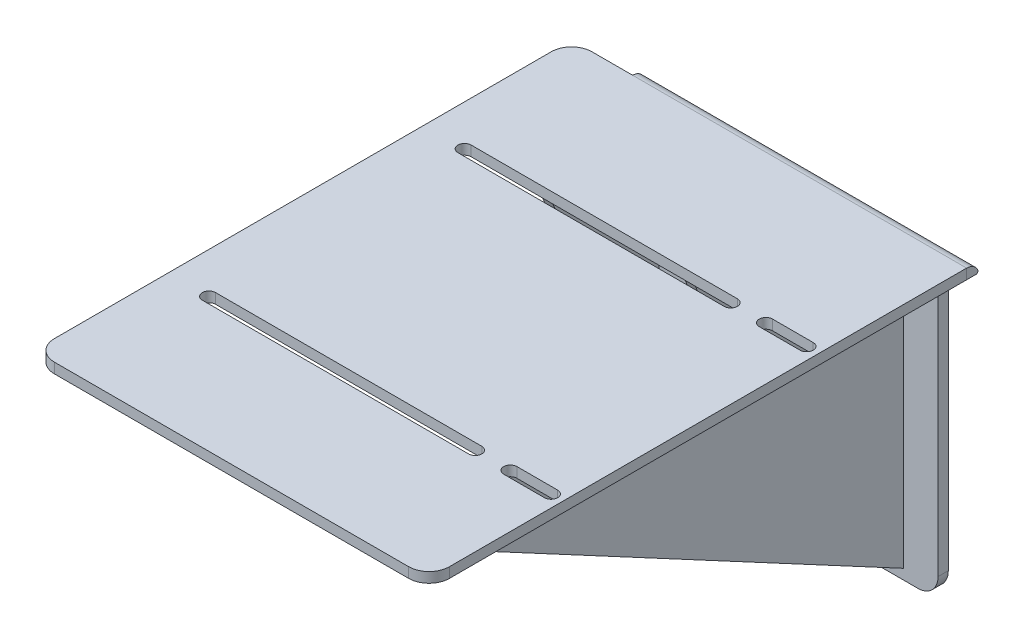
ISO-10303-21;
HEADER;
FILE_DESCRIPTION(('STEP AP214'),'2;1');
FILE_NAME('part.step','',(''),(''),'','','');
FILE_SCHEMA(('AUTOMOTIVE_DESIGN { 1 0 10303 214 1 1 1 1 }'));
ENDSEC;
DATA;
#1=APPLICATION_CONTEXT('core data for automotive mechanical design processes');
#2=APPLICATION_PROTOCOL_DEFINITION('international standard','automotive_design',2000,#1);
#3=PRODUCT_CONTEXT('',#1,'mechanical');
#4=PRODUCT('Part','Part','',(#3));
#5=PRODUCT_RELATED_PRODUCT_CATEGORY('part','',(#4));
#6=PRODUCT_DEFINITION_FORMATION('','',#4);
#7=PRODUCT_DEFINITION_CONTEXT('part definition',#1,'design');
#8=PRODUCT_DEFINITION('design','',#6,#7);
#9=PRODUCT_DEFINITION_SHAPE('','',#8);
#10=(LENGTH_UNIT() NAMED_UNIT(*) SI_UNIT(.MILLI.,.METRE.));
#11=(NAMED_UNIT(*) PLANE_ANGLE_UNIT() SI_UNIT($,.RADIAN.));
#12=(NAMED_UNIT(*) SI_UNIT($,.STERADIAN.) SOLID_ANGLE_UNIT());
#13=UNCERTAINTY_MEASURE_WITH_UNIT(LENGTH_MEASURE(1.E-05),#10,'distance_accuracy_value','');
#14=(GEOMETRIC_REPRESENTATION_CONTEXT(3) GLOBAL_UNCERTAINTY_ASSIGNED_CONTEXT((#13)) GLOBAL_UNIT_ASSIGNED_CONTEXT((#10,
#11,#12)) REPRESENTATION_CONTEXT('',''));
#15=CARTESIAN_POINT('',(0.,0.,0.));
#16=DIRECTION('',(0.,0.,1.));
#17=DIRECTION('',(1.,0.,0.));
#18=AXIS2_PLACEMENT_3D('',#15,#16,#17);
#19=CARTESIAN_POINT('',(0.,0.,0.));
#20=DIRECTION('',(0.,0.,1.));
#21=DIRECTION('',(1.,0.,0.));
#22=AXIS2_PLACEMENT_3D('',#19,#20,#21);
#23=PLANE('',#22);
#24=CARTESIAN_POINT('',(96.5,54.2,0.));
#25=DIRECTION('',(0.,0.,1.));
#26=DIRECTION('',(1.,0.,0.));
#27=AXIS2_PLACEMENT_3D('',#24,#25,#26);
#28=CIRCLE('',#27,5.);
#29=CARTESIAN_POINT('',(101.5,54.2,0.));
#30=VERTEX_POINT('',#29);
#31=CARTESIAN_POINT('',(91.5,54.2,0.));
#32=VERTEX_POINT('',#31);
#33=EDGE_CURVE('E726',#30,#32,#28,.T.);
#34=ORIENTED_EDGE('',*,*,#33,.F.);
#35=DIRECTION('',(0.,1.,0.));
#36=VECTOR('',#35,1.);
#37=CARTESIAN_POINT('',(101.5,0.,0.));
#38=LINE('',#37,#36);
#39=CARTESIAN_POINT('',(101.5,-70.,0.));
#40=VERTEX_POINT('',#39);
#41=EDGE_CURVE('E707',#40,#30,#38,.T.);
#42=ORIENTED_EDGE('',*,*,#41,.F.);
#43=CARTESIAN_POINT('',(96.5,-70.,0.));
#44=DIRECTION('',(0.,0.,1.));
#45=DIRECTION('',(1.,0.,0.));
#46=AXIS2_PLACEMENT_3D('',#43,#44,#45);
#47=CIRCLE('',#46,5.);
#48=CARTESIAN_POINT('',(91.5,-70.,0.));
#49=VERTEX_POINT('',#48);
#50=EDGE_CURVE('E719',#49,#40,#47,.T.);
#51=ORIENTED_EDGE('',*,*,#50,.F.);
#52=DIRECTION('',(0.,-1.,0.));
#53=VECTOR('',#52,1.);
#54=CARTESIAN_POINT('',(91.5,0.,0.));
#55=LINE('',#54,#53);
#56=EDGE_CURVE('E723',#32,#49,#55,.T.);
#57=ORIENTED_EDGE('',*,*,#56,.F.);
#58=EDGE_LOOP('',(#34,#42,#51,#57));
#59=FACE_BOUND('',#58,.T.);
#60=DIRECTION('',(1.,0.,0.));
#61=VECTOR('',#60,1.);
#62=CARTESIAN_POINT('',(-30.,-80.,0.));
#63=LINE('',#62,#61);
#64=CARTESIAN_POINT('',(0.,-80.,0.));
#65=VERTEX_POINT('',#64);
#66=CARTESIAN_POINT('',(129.,-80.,0.));
#67=VERTEX_POINT('',#66);
#68=EDGE_CURVE('E729',#65,#67,#63,.T.);
#69=ORIENTED_EDGE('',*,*,#68,.T.);
#70=CARTESIAN_POINT('',(129.,-70.,0.));
#71=DIRECTION('',(0.,0.,1.));
#72=DIRECTION('',(1.,0.,0.));
#73=AXIS2_PLACEMENT_3D('',#70,#71,#72);
#74=CIRCLE('',#73,10.);
#75=CARTESIAN_POINT('',(139.,-70.,0.));
#76=VERTEX_POINT('',#75);
#77=EDGE_CURVE('E842',#67,#76,#74,.T.);
#78=ORIENTED_EDGE('',*,*,#77,.T.);
#79=DIRECTION('',(0.,1.,0.));
#80=VECTOR('',#79,1.);
#81=CARTESIAN_POINT('',(139.,0.,0.));
#82=LINE('',#81,#80);
#83=CARTESIAN_POINT('',(139.,63.2,-1.44632569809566E-13));
#84=VERTEX_POINT('',#83);
#85=EDGE_CURVE('E460',#76,#84,#82,.T.);
#86=ORIENTED_EDGE('',*,*,#85,.T.);
#87=DIRECTION('',(-1.,0.,0.));
#88=VECTOR('',#87,1.);
#89=CARTESIAN_POINT('',(-30.,63.2,0.));
#90=LINE('',#89,#88);
#91=CARTESIAN_POINT('',(122.,63.2,-1.33573707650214E-13));
#92=VERTEX_POINT('',#91);
#93=EDGE_CURVE('E687',#92,#84,#90,.F.);
#94=ORIENTED_EDGE('',*,*,#93,.F.);
#95=DIRECTION('',(0.,1.,0.));
#96=VECTOR('',#95,1.);
#97=CARTESIAN_POINT('',(122.,0.,0.));
#98=LINE('',#97,#96);
#99=CARTESIAN_POINT('',(122.,-75.,0.));
#100=VERTEX_POINT('',#99);
#101=EDGE_CURVE('E496',#100,#92,#98,.T.);
#102=ORIENTED_EDGE('',*,*,#101,.F.);
#103=DIRECTION('',(1.,0.,0.));
#104=VECTOR('',#103,1.);
#105=CARTESIAN_POINT('',(0.,-75.,0.));
#106=LINE('',#105,#104);
#107=CARTESIAN_POINT('',(117.,-75.,0.));
#108=VERTEX_POINT('',#107);
#109=EDGE_CURVE('E503',#108,#100,#106,.T.);
#110=ORIENTED_EDGE('',*,*,#109,.F.);
#111=DIRECTION('',(0.,1.,0.));
#112=VECTOR('',#111,1.);
#113=CARTESIAN_POINT('',(117.,0.,0.));
#114=LINE('',#113,#112);
#115=CARTESIAN_POINT('',(117.,63.2,-1.30321101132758E-13));
#116=VERTEX_POINT('',#115);
#117=EDGE_CURVE('E486',#108,#116,#114,.T.);
#118=ORIENTED_EDGE('',*,*,#117,.T.);
#119=CARTESIAN_POINT('',(72.,63.2,-1.01047642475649E-13));
#120=VERTEX_POINT('',#119);
#121=EDGE_CURVE('E973',#120,#116,#90,.F.);
#122=ORIENTED_EDGE('',*,*,#121,.F.);
#123=DIRECTION('',(0.,1.,0.));
#124=VECTOR('',#123,1.);
#125=CARTESIAN_POINT('',(72.,0.,0.));
#126=LINE('',#125,#124);
#127=CARTESIAN_POINT('',(72.,-75.7999999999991,0.));
#128=VERTEX_POINT('',#127);
#129=EDGE_CURVE('E525',#128,#120,#126,.T.);
#130=ORIENTED_EDGE('',*,*,#129,.F.);
#131=DIRECTION('',(1.,0.,0.));
#132=VECTOR('',#131,1.);
#133=CARTESIAN_POINT('',(0.,-75.7999999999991,0.));
#134=LINE('',#133,#132);
#135=CARTESIAN_POINT('',(67.,-75.7999999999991,0.));
#136=VERTEX_POINT('',#135);
#137=EDGE_CURVE('E529',#136,#128,#134,.T.);
#138=ORIENTED_EDGE('',*,*,#137,.F.);
#139=DIRECTION('',(0.,1.,0.));
#140=VECTOR('',#139,1.);
#141=CARTESIAN_POINT('',(67.,0.,0.));
#142=LINE('',#141,#140);
#143=CARTESIAN_POINT('',(67.,63.2,0.));
#144=VERTEX_POINT('',#143);
#145=EDGE_CURVE('E519',#136,#144,#142,.T.);
#146=ORIENTED_EDGE('',*,*,#145,.T.);
#147=CARTESIAN_POINT('',(1.99999999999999,63.2,0.));
#148=VERTEX_POINT('',#147);
#149=EDGE_CURVE('E686',#148,#144,#90,.F.);
#150=ORIENTED_EDGE('',*,*,#149,.F.);
#151=DIRECTION('',(0.,1.,0.));
#152=VECTOR('',#151,1.);
#153=CARTESIAN_POINT('',(1.99999999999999,0.,0.));
#154=LINE('',#153,#152);
#155=CARTESIAN_POINT('',(1.99999999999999,-75.7999999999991,0.));
#156=VERTEX_POINT('',#155);
#157=EDGE_CURVE('E551',#156,#148,#154,.T.);
#158=ORIENTED_EDGE('',*,*,#157,.F.);
#159=DIRECTION('',(1.,0.,0.));
#160=VECTOR('',#159,1.);
#161=CARTESIAN_POINT('',(0.,-75.7999999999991,0.));
#162=LINE('',#161,#160);
#163=CARTESIAN_POINT('',(-3.00000000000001,-75.7999999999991,0.));
#164=VERTEX_POINT('',#163);
#165=EDGE_CURVE('E555',#164,#156,#162,.T.);
#166=ORIENTED_EDGE('',*,*,#165,.F.);
#167=DIRECTION('',(0.,1.,0.));
#168=VECTOR('',#167,1.);
#169=CARTESIAN_POINT('',(-3.00000000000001,0.,0.));
#170=LINE('',#169,#168);
#171=CARTESIAN_POINT('',(-3.00000000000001,63.2,0.));
#172=VERTEX_POINT('',#171);
#173=EDGE_CURVE('E545',#164,#172,#170,.T.);
#174=ORIENTED_EDGE('',*,*,#173,.T.);
#175=CARTESIAN_POINT('',(-10.,63.2,0.));
#176=VERTEX_POINT('',#175);
#177=EDGE_CURVE('E682',#176,#172,#90,.F.);
#178=ORIENTED_EDGE('',*,*,#177,.F.);
#179=DIRECTION('',(0.,1.,0.));
#180=VECTOR('',#179,1.);
#181=CARTESIAN_POINT('',(-10.,0.,0.));
#182=LINE('',#181,#180);
#183=CARTESIAN_POINT('',(-10.,-70.,0.));
#184=VERTEX_POINT('',#183);
#185=EDGE_CURVE('E648',#184,#176,#182,.T.);
#186=ORIENTED_EDGE('',*,*,#185,.F.);
#187=CARTESIAN_POINT('',(0.,-70.,0.));
#188=DIRECTION('',(0.,0.,1.));
#189=DIRECTION('',(1.,0.,0.));
#190=AXIS2_PLACEMENT_3D('',#187,#188,#189);
#191=CIRCLE('',#190,10.);
#192=EDGE_CURVE('E778',#184,#65,#191,.T.);
#193=ORIENTED_EDGE('',*,*,#192,.T.);
#194=EDGE_LOOP('',(#69,#78,#86,#94,#102,#110,#118,#122,#130,#138,#146,#150,#158,#166,#174,#178,
#186,#193));
#195=FACE_BOUND('',#194,.T.);
#196=ADVANCED_FACE('F47',(#59,#195),#23,.T.);
#197=CARTESIAN_POINT('',(0.,0.,-5.));
#198=DIRECTION('',(0.,0.,1.));
#199=DIRECTION('',(1.,0.,0.));
#200=AXIS2_PLACEMENT_3D('',#197,#198,#199);
#201=PLANE('',#200);
#202=DIRECTION('',(0.,-1.,0.));
#203=VECTOR('',#202,1.);
#204=CARTESIAN_POINT('',(101.5,54.2,-5.00000000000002));
#205=LINE('',#204,#203);
#206=CARTESIAN_POINT('',(101.5,54.2,-5.));
#207=VERTEX_POINT('',#206);
#208=CARTESIAN_POINT('',(101.5,-70.,-5.00000000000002));
#209=VERTEX_POINT('',#208);
#210=EDGE_CURVE('E691',#207,#209,#205,.T.);
#211=ORIENTED_EDGE('',*,*,#210,.F.);
#212=CARTESIAN_POINT('',(96.5,54.2,-5.00000000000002));
#213=DIRECTION('',(0.,0.,-1.));
#214=DIRECTION('',(-1.,0.,0.));
#215=AXIS2_PLACEMENT_3D('',#212,#213,#214);
#216=CIRCLE('',#215,5.);
#217=CARTESIAN_POINT('',(91.5,54.2,-5.00000000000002));
#218=VERTEX_POINT('',#217);
#219=EDGE_CURVE('E688',#218,#207,#216,.T.);
#220=ORIENTED_EDGE('',*,*,#219,.F.);
#221=DIRECTION('',(0.,1.,0.));
#222=VECTOR('',#221,1.);
#223=CARTESIAN_POINT('',(91.5,54.2,-5.00000000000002));
#224=LINE('',#223,#222);
#225=CARTESIAN_POINT('',(91.5,-70.,-5.00000000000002));
#226=VERTEX_POINT('',#225);
#227=EDGE_CURVE('E699',#226,#218,#224,.T.);
#228=ORIENTED_EDGE('',*,*,#227,.F.);
#229=CARTESIAN_POINT('',(96.5,-70.,-5.00000000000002));
#230=DIRECTION('',(0.,0.,-1.));
#231=DIRECTION('',(-1.,0.,0.));
#232=AXIS2_PLACEMENT_3D('',#229,#230,#231);
#233=CIRCLE('',#232,5.);
#234=EDGE_CURVE('E695',#209,#226,#233,.T.);
#235=ORIENTED_EDGE('',*,*,#234,.F.);
#236=EDGE_LOOP('',(#211,#220,#228,#235));
#237=FACE_BOUND('',#236,.T.);
#238=DIRECTION('',(0.,1.,0.));
#239=VECTOR('',#238,1.);
#240=CARTESIAN_POINT('',(139.,0.,-5.));
#241=LINE('',#240,#239);
#242=CARTESIAN_POINT('',(139.,-70.,-5.));
#243=VERTEX_POINT('',#242);
#244=CARTESIAN_POINT('',(139.,63.2,-5.00000000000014));
#245=VERTEX_POINT('',#244);
#246=EDGE_CURVE('E467',#243,#245,#241,.T.);
#247=ORIENTED_EDGE('',*,*,#246,.F.);
#248=CARTESIAN_POINT('',(129.,-70.,-5.));
#249=DIRECTION('',(0.,0.,1.));
#250=DIRECTION('',(1.,0.,0.));
#251=AXIS2_PLACEMENT_3D('',#248,#249,#250);
#252=CIRCLE('',#251,10.);
#253=CARTESIAN_POINT('',(129.,-80.,-5.));
#254=VERTEX_POINT('',#253);
#255=EDGE_CURVE('E836',#243,#254,#252,.F.);
#256=ORIENTED_EDGE('',*,*,#255,.T.);
#257=DIRECTION('',(1.,0.,0.));
#258=VECTOR('',#257,1.);
#259=CARTESIAN_POINT('',(-30.,-80.,-5.));
#260=LINE('',#259,#258);
#261=CARTESIAN_POINT('',(0.,-80.,-5.));
#262=VERTEX_POINT('',#261);
#263=EDGE_CURVE('E730',#262,#254,#260,.T.);
#264=ORIENTED_EDGE('',*,*,#263,.F.);
#265=CARTESIAN_POINT('',(0.,-70.,-5.));
#266=DIRECTION('',(0.,0.,1.));
#267=DIRECTION('',(1.,0.,0.));
#268=AXIS2_PLACEMENT_3D('',#265,#266,#267);
#269=CIRCLE('',#268,10.);
#270=CARTESIAN_POINT('',(-10.,-70.,-5.));
#271=VERTEX_POINT('',#270);
#272=EDGE_CURVE('E773',#262,#271,#269,.F.);
#273=ORIENTED_EDGE('',*,*,#272,.T.);
#274=DIRECTION('',(0.,-1.,0.));
#275=VECTOR('',#274,1.);
#276=CARTESIAN_POINT('',(-10.,69.2,-5.));
#277=LINE('',#276,#275);
#278=CARTESIAN_POINT('',(-10.,63.2,-5.));
#279=VERTEX_POINT('',#278);
#280=EDGE_CURVE('E602',#279,#271,#277,.T.);
#281=ORIENTED_EDGE('',*,*,#280,.F.);
#282=DIRECTION('',(-1.,0.,0.));
#283=VECTOR('',#282,1.);
#284=CARTESIAN_POINT('',(-30.,63.2,-5.00000000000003));
#285=LINE('',#284,#283);
#286=EDGE_CURVE('E677',#279,#245,#285,.F.);
#287=ORIENTED_EDGE('',*,*,#286,.T.);
#288=EDGE_LOOP('',(#247,#256,#264,#273,#281,#287));
#289=FACE_BOUND('',#288,.T.);
#290=ADVANCED_FACE('F869',(#237,#289),#201,.F.);
#291=CARTESIAN_POINT('',(-30.,-80.,-5.));
#292=DIRECTION('',(0.,-1.,0.));
#293=DIRECTION('',(0.,0.,-1.));
#294=AXIS2_PLACEMENT_3D('',#291,#292,#293);
#295=PLANE('',#294);
#296=ORIENTED_EDGE('',*,*,#263,.T.);
#297=DIRECTION('',(0.,0.,-1.));
#298=VECTOR('',#297,1.);
#299=CARTESIAN_POINT('',(129.,-80.,-5.));
#300=LINE('',#299,#298);
#301=EDGE_CURVE('E839',#254,#67,#300,.F.);
#302=ORIENTED_EDGE('',*,*,#301,.T.);
#303=ORIENTED_EDGE('',*,*,#68,.F.);
#304=DIRECTION('',(0.,0.,-1.));
#305=VECTOR('',#304,1.);
#306=CARTESIAN_POINT('',(0.,-80.,-5.));
#307=LINE('',#306,#305);
#308=EDGE_CURVE('E763',#65,#262,#307,.T.);
#309=ORIENTED_EDGE('',*,*,#308,.T.);
#310=EDGE_LOOP('',(#296,#302,#303,#309));
#311=FACE_BOUND('',#310,.T.);
#312=ADVANCED_FACE('F875',(#311),#295,.T.);
#313=CARTESIAN_POINT('',(154.,63.2,0.999999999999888));
#314=DIRECTION('',(1.,0.,0.));
#315=DIRECTION('',(0.,0.,-1.));
#316=AXIS2_PLACEMENT_3D('',#313,#314,#315);
#317=PLANE('',#316);
#318=DIRECTION('',(0.,0.,-1.));
#319=VECTOR('',#318,1.);
#320=CARTESIAN_POINT('',(154.,64.2000000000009,10.));
#321=LINE('',#320,#319);
#322=CARTESIAN_POINT('',(154.,64.2000000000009,0.999999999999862));
#323=VERTEX_POINT('',#322);
#324=CARTESIAN_POINT('',(154.,64.2000000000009,-3.58257569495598));
#325=VERTEX_POINT('',#324);
#326=EDGE_CURVE('E453',#323,#325,#321,.T.);
#327=ORIENTED_EDGE('',*,*,#326,.T.);
#328=CARTESIAN_POINT('',(154.,65.2,-3.58257569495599));
#329=DIRECTION('',(1.,0.,0.));
#330=DIRECTION('',(0.,0.,-1.));
#331=AXIS2_PLACEMENT_3D('',#328,#329,#330);
#332=CIRCLE('',#331,1.);
#333=CARTESIAN_POINT('',(154.,65.6,-4.49909083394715));
#334=VERTEX_POINT('',#333);
#335=EDGE_CURVE('E56',#325,#334,#332,.T.);
#336=ORIENTED_EDGE('',*,*,#335,.T.);
#337=CARTESIAN_POINT('',(154.,63.2,0.999999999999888));
#338=DIRECTION('',(1.,0.,0.));
#339=DIRECTION('',(0.,0.,-1.));
#340=AXIS2_PLACEMENT_3D('',#337,#338,#339);
#341=CIRCLE('',#340,6.00000000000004);
#342=CARTESIAN_POINT('',(154.,69.2,0.999999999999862));
#343=VERTEX_POINT('',#342);
#344=EDGE_CURVE('E681',#334,#343,#341,.T.);
#345=ORIENTED_EDGE('',*,*,#344,.T.);
#346=DIRECTION('',(0.,1.,0.));
#347=VECTOR('',#346,1.);
#348=CARTESIAN_POINT('',(154.,69.2000000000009,0.99999999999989));
#349=LINE('',#348,#347);
#350=EDGE_CURVE('E657',#323,#343,#349,.T.);
#351=ORIENTED_EDGE('',*,*,#350,.F.);
#352=EDGE_LOOP('',(#327,#336,#345,#351));
#353=FACE_BOUND('',#352,.T.);
#354=ADVANCED_FACE('F854',(#353),#317,.T.);
#355=CARTESIAN_POINT('',(-30.,63.2,1.00000000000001));
#356=DIRECTION('',(-1.,0.,0.));
#357=DIRECTION('',(0.,1.,0.));
#358=AXIS2_PLACEMENT_3D('',#355,#356,#357);
#359=CYLINDRICAL_SURFACE('',#358,6.00000000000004);
#360=ORIENTED_EDGE('',*,*,#344,.F.);
#361=DIRECTION('',(-1.,0.,0.));
#362=VECTOR('',#361,1.);
#363=CARTESIAN_POINT('',(-30.,65.6,-4.49909083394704));
#364=LINE('',#363,#362);
#365=CARTESIAN_POINT('',(139.,65.6,-4.49909083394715));
#366=VERTEX_POINT('',#365);
#367=EDGE_CURVE('E845',#334,#366,#364,.T.);
#368=ORIENTED_EDGE('',*,*,#367,.T.);
#369=CARTESIAN_POINT('',(139.,63.2,0.999999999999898));
#370=DIRECTION('',(1.,0.,0.));
#371=DIRECTION('',(0.,0.,-1.));
#372=AXIS2_PLACEMENT_3D('',#369,#370,#371);
#373=CIRCLE('',#372,6.00000000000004);
#374=EDGE_CURVE('E463',#366,#245,#373,.F.);
#375=ORIENTED_EDGE('',*,*,#374,.T.);
#376=ORIENTED_EDGE('',*,*,#286,.F.);
#377=CARTESIAN_POINT('',(-10.,63.2,0.999999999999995));
#378=DIRECTION('',(1.,0.,0.));
#379=DIRECTION('',(0.,1.,0.));
#380=AXIS2_PLACEMENT_3D('',#377,#378,#379);
#381=CIRCLE('',#380,6.00000000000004);
#382=CARTESIAN_POINT('',(-10.,69.2,1.));
#383=VERTEX_POINT('',#382);
#384=EDGE_CURVE('E654',#383,#279,#381,.F.);
#385=ORIENTED_EDGE('',*,*,#384,.F.);
#386=DIRECTION('',(-1.,0.,0.));
#387=VECTOR('',#386,1.);
#388=CARTESIAN_POINT('',(0.,69.2,0.999999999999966));
#389=LINE('',#388,#387);
#390=EDGE_CURVE('E661',#343,#383,#389,.T.);
#391=ORIENTED_EDGE('',*,*,#390,.F.);
#392=EDGE_LOOP('',(#360,#368,#375,#376,#385,#391));
#393=FACE_BOUND('',#392,.T.);
#394=ADVANCED_FACE('F860',(#393),#359,.T.);
#395=CARTESIAN_POINT('',(-30.,63.2,1.00000000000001));
#396=DIRECTION('',(-1.,0.,0.));
#397=DIRECTION('',(0.,1.,0.));
#398=AXIS2_PLACEMENT_3D('',#395,#396,#397);
#399=CYLINDRICAL_SURFACE('',#398,1.00000000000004);
#400=CARTESIAN_POINT('',(139.,63.2,0.999999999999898));
#401=DIRECTION('',(1.,0.,0.));
#402=DIRECTION('',(0.,0.,-1.));
#403=AXIS2_PLACEMENT_3D('',#400,#401,#402);
#404=CIRCLE('',#403,1.00000000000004);
#405=CARTESIAN_POINT('',(139.,64.2,0.9999999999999));
#406=VERTEX_POINT('',#405);
#407=EDGE_CURVE('E456',#406,#84,#404,.F.);
#408=ORIENTED_EDGE('',*,*,#407,.F.);
#409=DIRECTION('',(-1.,0.,0.));
#410=VECTOR('',#409,1.);
#411=CARTESIAN_POINT('',(109.,64.2,0.999999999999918));
#412=LINE('',#411,#410);
#413=CARTESIAN_POINT('',(122.,64.2,0.99999999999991));
#414=VERTEX_POINT('',#413);
#415=EDGE_CURVE('E658',#406,#414,#412,.T.);
#416=ORIENTED_EDGE('',*,*,#415,.T.);
#417=CARTESIAN_POINT('',(122.,63.2,0.999999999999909));
#418=DIRECTION('',(1.,0.,0.));
#419=DIRECTION('',(0.,0.,-1.));
#420=AXIS2_PLACEMENT_3D('',#417,#418,#419);
#421=CIRCLE('',#420,1.00000000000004);
#422=EDGE_CURVE('E493',#414,#92,#421,.F.);
#423=ORIENTED_EDGE('',*,*,#422,.T.);
#424=ORIENTED_EDGE('',*,*,#93,.T.);
#425=EDGE_LOOP('',(#408,#416,#423,#424));
#426=FACE_BOUND('',#425,.T.);
#427=ADVANCED_FACE('F990',(#426),#399,.F.);
#428=CARTESIAN_POINT('',(117.,63.2,0.999999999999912));
#429=DIRECTION('',(1.,0.,0.));
#430=DIRECTION('',(0.,0.,-1.));
#431=AXIS2_PLACEMENT_3D('',#428,#429,#430);
#432=CIRCLE('',#431,1.00000000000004);
#433=CARTESIAN_POINT('',(117.,64.2,0.999999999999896));
#434=VERTEX_POINT('',#433);
#435=EDGE_CURVE('E482',#434,#116,#432,.F.);
#436=ORIENTED_EDGE('',*,*,#435,.F.);
#437=CARTESIAN_POINT('',(72.,64.2,0.99999999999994));
#438=VERTEX_POINT('',#437);
#439=EDGE_CURVE('E662',#434,#438,#412,.T.);
#440=ORIENTED_EDGE('',*,*,#439,.T.);
#441=CARTESIAN_POINT('',(72.,63.2,0.999999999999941));
#442=DIRECTION('',(1.,0.,0.));
#443=DIRECTION('',(0.,0.,-1.));
#444=AXIS2_PLACEMENT_3D('',#441,#442,#443);
#445=CIRCLE('',#444,1.00000000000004);
#446=EDGE_CURVE('E522',#438,#120,#445,.F.);
#447=ORIENTED_EDGE('',*,*,#446,.T.);
#448=ORIENTED_EDGE('',*,*,#121,.T.);
#449=EDGE_LOOP('',(#436,#440,#447,#448));
#450=FACE_BOUND('',#449,.T.);
#451=ADVANCED_FACE('F963',(#450),#399,.F.);
#452=CARTESIAN_POINT('',(67.,63.2,0.999999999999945));
#453=DIRECTION('',(1.,0.,0.));
#454=DIRECTION('',(0.,0.,-1.));
#455=AXIS2_PLACEMENT_3D('',#452,#453,#454);
#456=CIRCLE('',#455,1.00000000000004);
#457=CARTESIAN_POINT('',(67.,64.2,0.999999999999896));
#458=VERTEX_POINT('',#457);
#459=EDGE_CURVE('E512',#458,#144,#456,.F.);
#460=ORIENTED_EDGE('',*,*,#459,.F.);
#461=CARTESIAN_POINT('',(1.99999999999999,64.1999999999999,0.999999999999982));
#462=VERTEX_POINT('',#461);
#463=EDGE_CURVE('E954',#458,#462,#412,.T.);
#464=ORIENTED_EDGE('',*,*,#463,.T.);
#465=CARTESIAN_POINT('',(1.99999999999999,63.2,0.999999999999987));
#466=DIRECTION('',(1.,0.,0.));
#467=DIRECTION('',(0.,0.,-1.));
#468=AXIS2_PLACEMENT_3D('',#465,#466,#467);
#469=CIRCLE('',#468,1.00000000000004);
#470=EDGE_CURVE('E548',#462,#148,#469,.F.);
#471=ORIENTED_EDGE('',*,*,#470,.T.);
#472=ORIENTED_EDGE('',*,*,#149,.T.);
#473=EDGE_LOOP('',(#460,#464,#471,#472));
#474=FACE_BOUND('',#473,.T.);
#475=ADVANCED_FACE('F981',(#474),#399,.F.);
#476=CARTESIAN_POINT('',(-3.00000000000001,63.2,0.99999999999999));
#477=DIRECTION('',(1.,0.,0.));
#478=DIRECTION('',(0.,0.,-1.));
#479=AXIS2_PLACEMENT_3D('',#476,#477,#478);
#480=CIRCLE('',#479,1.00000000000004);
#481=CARTESIAN_POINT('',(-3.00000000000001,64.2,0.999999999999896));
#482=VERTEX_POINT('',#481);
#483=EDGE_CURVE('E538',#482,#172,#480,.F.);
#484=ORIENTED_EDGE('',*,*,#483,.F.);
#485=CARTESIAN_POINT('',(-10.,64.1999999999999,0.999999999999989));
#486=VERTEX_POINT('',#485);
#487=EDGE_CURVE('E952',#482,#486,#412,.T.);
#488=ORIENTED_EDGE('',*,*,#487,.T.);
#489=CARTESIAN_POINT('',(-10.,63.2,0.999999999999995));
#490=DIRECTION('',(1.,0.,0.));
#491=DIRECTION('',(0.,1.,0.));
#492=AXIS2_PLACEMENT_3D('',#489,#490,#491);
#493=CIRCLE('',#492,1.00000000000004);
#494=EDGE_CURVE('E734',#486,#176,#493,.F.);
#495=ORIENTED_EDGE('',*,*,#494,.T.);
#496=ORIENTED_EDGE('',*,*,#177,.T.);
#497=EDGE_LOOP('',(#484,#488,#495,#496));
#498=FACE_BOUND('',#497,.T.);
#499=ADVANCED_FACE('F1020',(#498),#399,.F.);
#500=CARTESIAN_POINT('',(96.5,54.2,4.99999999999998));
#501=DIRECTION('',(0.,0.,-1.));
#502=DIRECTION('',(-1.,0.,0.));
#503=AXIS2_PLACEMENT_3D('',#500,#501,#502);
#504=CYLINDRICAL_SURFACE('',#503,5.);
#505=ORIENTED_EDGE('',*,*,#33,.T.);
#506=DIRECTION('',(0.,0.,-1.));
#507=VECTOR('',#506,1.);
#508=CARTESIAN_POINT('',(91.5,54.2,4.99999999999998));
#509=LINE('',#508,#507);
#510=EDGE_CURVE('E704',#32,#218,#509,.T.);
#511=ORIENTED_EDGE('',*,*,#510,.T.);
#512=ORIENTED_EDGE('',*,*,#219,.T.);
#513=DIRECTION('',(0.,0.,-1.));
#514=VECTOR('',#513,1.);
#515=CARTESIAN_POINT('',(101.5,54.2,4.99999999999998));
#516=LINE('',#515,#514);
#517=EDGE_CURVE('E703',#30,#207,#516,.T.);
#518=ORIENTED_EDGE('',*,*,#517,.F.);
#519=EDGE_LOOP('',(#505,#511,#512,#518));
#520=FACE_BOUND('',#519,.T.);
#521=ADVANCED_FACE('F1094',(#520),#504,.F.);
#522=CARTESIAN_POINT('',(91.5,54.2,4.99999999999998));
#523=DIRECTION('',(-1.,0.,0.));
#524=DIRECTION('',(0.,-1.,0.));
#525=AXIS2_PLACEMENT_3D('',#522,#523,#524);
#526=PLANE('',#525);
#527=ORIENTED_EDGE('',*,*,#56,.T.);
#528=DIRECTION('',(0.,0.,-1.));
#529=VECTOR('',#528,1.);
#530=CARTESIAN_POINT('',(91.5,-70.,4.99999999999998));
#531=LINE('',#530,#529);
#532=EDGE_CURVE('E708',#49,#226,#531,.T.);
#533=ORIENTED_EDGE('',*,*,#532,.T.);
#534=ORIENTED_EDGE('',*,*,#227,.T.);
#535=ORIENTED_EDGE('',*,*,#510,.F.);
#536=EDGE_LOOP('',(#527,#533,#534,#535));
#537=FACE_BOUND('',#536,.T.);
#538=ADVANCED_FACE('F1090',(#537),#526,.F.);
#539=CARTESIAN_POINT('',(96.5,-70.,4.99999999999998));
#540=DIRECTION('',(0.,0.,-1.));
#541=DIRECTION('',(-1.,0.,0.));
#542=AXIS2_PLACEMENT_3D('',#539,#540,#541);
#543=CYLINDRICAL_SURFACE('',#542,5.);
#544=ORIENTED_EDGE('',*,*,#50,.T.);
#545=DIRECTION('',(0.,0.,-1.));
#546=VECTOR('',#545,1.);
#547=CARTESIAN_POINT('',(101.5,-70.,4.99999999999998));
#548=LINE('',#547,#546);
#549=EDGE_CURVE('E711',#40,#209,#548,.T.);
#550=ORIENTED_EDGE('',*,*,#549,.T.);
#551=ORIENTED_EDGE('',*,*,#234,.T.);
#552=ORIENTED_EDGE('',*,*,#532,.F.);
#553=EDGE_LOOP('',(#544,#550,#551,#552));
#554=FACE_BOUND('',#553,.T.);
#555=ADVANCED_FACE('F1093',(#554),#543,.F.);
#556=CARTESIAN_POINT('',(101.5,54.2,4.99999999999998));
#557=DIRECTION('',(1.,0.,0.));
#558=DIRECTION('',(0.,1.,0.));
#559=AXIS2_PLACEMENT_3D('',#556,#557,#558);
#560=PLANE('',#559);
#561=ORIENTED_EDGE('',*,*,#41,.T.);
#562=ORIENTED_EDGE('',*,*,#517,.T.);
#563=ORIENTED_EDGE('',*,*,#210,.T.);
#564=ORIENTED_EDGE('',*,*,#549,.F.);
#565=EDGE_LOOP('',(#561,#562,#563,#564));
#566=FACE_BOUND('',#565,.T.);
#567=ADVANCED_FACE('F889',(#566),#560,.F.);
#568=CARTESIAN_POINT('',(-40.,69.2,0.));
#569=DIRECTION('',(-1.,0.,0.));
#570=DIRECTION('',(0.,0.,1.));
#571=AXIS2_PLACEMENT_3D('',#568,#569,#570);
#572=PLANE('',#571);
#573=DIRECTION('',(0.,0.,-1.));
#574=VECTOR('',#573,1.);
#575=CARTESIAN_POINT('',(-40.,64.2,0.));
#576=LINE('',#575,#574);
#577=CARTESIAN_POINT('',(-39.9999999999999,64.2000000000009,255.));
#578=VERTEX_POINT('',#577);
#579=CARTESIAN_POINT('',(-40.,64.2,11.));
#580=VERTEX_POINT('',#579);
#581=EDGE_CURVE('E676',#578,#580,#576,.T.);
#582=ORIENTED_EDGE('',*,*,#581,.F.);
#583=DIRECTION('',(0.,-1.,0.));
#584=VECTOR('',#583,1.);
#585=CARTESIAN_POINT('',(-39.9999999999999,69.2000000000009,255.));
#586=LINE('',#585,#584);
#587=CARTESIAN_POINT('',(-39.9999999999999,69.2000000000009,255.));
#588=VERTEX_POINT('',#587);
#589=EDGE_CURVE('E794',#578,#588,#586,.F.);
#590=ORIENTED_EDGE('',*,*,#589,.T.);
#591=DIRECTION('',(0.,0.,-1.));
#592=VECTOR('',#591,1.);
#593=CARTESIAN_POINT('',(-40.,69.2,0.));
#594=LINE('',#593,#592);
#595=CARTESIAN_POINT('',(-40.,69.2000000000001,11.));
#596=VERTEX_POINT('',#595);
#597=EDGE_CURVE('E671',#588,#596,#594,.T.);
#598=ORIENTED_EDGE('',*,*,#597,.T.);
#599=DIRECTION('',(0.,1.,0.));
#600=VECTOR('',#599,1.);
#601=CARTESIAN_POINT('',(-40.,64.1999999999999,11.));
#602=LINE('',#601,#600);
#603=EDGE_CURVE('E791',#596,#580,#602,.F.);
#604=ORIENTED_EDGE('',*,*,#603,.T.);
#605=EDGE_LOOP('',(#582,#590,#598,#604));
#606=FACE_BOUND('',#605,.T.);
#607=ADVANCED_FACE('F885',(#606),#572,.T.);
#608=CARTESIAN_POINT('',(154.,69.2000000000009,265.));
#609=DIRECTION('',(1.,0.,0.));
#610=DIRECTION('',(0.,0.,-1.));
#611=AXIS2_PLACEMENT_3D('',#608,#609,#610);
#612=PLANE('',#611);
#613=DIRECTION('',(0.,0.,1.));
#614=VECTOR('',#613,1.);
#615=CARTESIAN_POINT('',(154.,69.2000000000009,265.));
#616=LINE('',#615,#614);
#617=CARTESIAN_POINT('',(154.,69.2000000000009,255.));
#618=VERTEX_POINT('',#617);
#619=EDGE_CURVE('E672',#343,#618,#616,.T.);
#620=ORIENTED_EDGE('',*,*,#619,.T.);
#621=DIRECTION('',(0.,-1.,0.));
#622=VECTOR('',#621,1.);
#623=CARTESIAN_POINT('',(154.,69.2000000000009,255.));
#624=LINE('',#623,#622);
#625=CARTESIAN_POINT('',(154.,64.2000000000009,255.));
#626=VERTEX_POINT('',#625);
#627=EDGE_CURVE('E808',#618,#626,#624,.T.);
#628=ORIENTED_EDGE('',*,*,#627,.T.);
#629=DIRECTION('',(0.,0.,1.));
#630=VECTOR('',#629,1.);
#631=CARTESIAN_POINT('',(154.,64.2000000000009,265.));
#632=LINE('',#631,#630);
#633=EDGE_CURVE('E667',#323,#626,#632,.T.);
#634=ORIENTED_EDGE('',*,*,#633,.F.);
#635=ORIENTED_EDGE('',*,*,#350,.T.);
#636=EDGE_LOOP('',(#620,#628,#634,#635));
#637=FACE_BOUND('',#636,.T.);
#638=ADVANCED_FACE('F888',(#637),#612,.T.);
#639=CARTESIAN_POINT('',(0.,69.2,-2.42717468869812E-13));
#640=DIRECTION('',(0.,1.,0.));
#641=DIRECTION('',(0.,0.,1.));
#642=AXIS2_PLACEMENT_3D('',#639,#640,#641);
#643=PLANE('',#642);
#644=CARTESIAN_POINT('',(128.,69.2000000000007,199.087972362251));
#645=DIRECTION('',(0.,1.,0.));
#646=DIRECTION('',(0.,0.,1.));
#647=AXIS2_PLACEMENT_3D('',#644,#645,#646);
#648=CIRCLE('',#647,3.25);
#649=CARTESIAN_POINT('',(128.,69.2000000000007,195.837972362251));
#650=VERTEX_POINT('',#649);
#651=CARTESIAN_POINT('',(128.,69.2000000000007,202.337972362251));
#652=VERTEX_POINT('',#651);
#653=EDGE_CURVE('E447',#650,#652,#648,.T.);
#654=ORIENTED_EDGE('',*,*,#653,.F.);
#655=DIRECTION('',(-1.,0.,0.));
#656=VECTOR('',#655,1.);
#657=CARTESIAN_POINT('',(0.,69.2000000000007,195.837972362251));
#658=LINE('',#657,#656);
#659=CARTESIAN_POINT('',(148.,69.2000000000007,195.837972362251));
#660=VERTEX_POINT('',#659);
#661=EDGE_CURVE('E439',#660,#650,#658,.T.);
#662=ORIENTED_EDGE('',*,*,#661,.F.);
#663=CARTESIAN_POINT('',(148.,69.2000000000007,199.087972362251));
#664=DIRECTION('',(0.,1.,0.));
#665=DIRECTION('',(0.,0.,1.));
#666=AXIS2_PLACEMENT_3D('',#663,#664,#665);
#667=CIRCLE('',#666,3.25);
#668=CARTESIAN_POINT('',(148.,69.2000000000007,202.337972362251));
#669=VERTEX_POINT('',#668);
#670=EDGE_CURVE('E362',#669,#660,#667,.T.);
#671=ORIENTED_EDGE('',*,*,#670,.F.);
#672=DIRECTION('',(1.,0.,0.));
#673=VECTOR('',#672,1.);
#674=CARTESIAN_POINT('',(0.,69.2000000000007,202.337972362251));
#675=LINE('',#674,#673);
#676=EDGE_CURVE('E444',#652,#669,#675,.T.);
#677=ORIENTED_EDGE('',*,*,#676,.F.);
#678=EDGE_LOOP('',(#654,#662,#671,#677));
#679=FACE_BOUND('',#678,.T.);
#680=CARTESIAN_POINT('',(128.,69.2000000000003,73.5879723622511));
#681=DIRECTION('',(0.,1.,0.));
#682=DIRECTION('',(0.,0.,1.));
#683=AXIS2_PLACEMENT_3D('',#680,#681,#682);
#684=CIRCLE('',#683,3.25);
#685=CARTESIAN_POINT('',(128.,69.2000000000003,70.3379723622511));
#686=VERTEX_POINT('',#685);
#687=CARTESIAN_POINT('',(128.,69.2000000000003,76.8379723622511));
#688=VERTEX_POINT('',#687);
#689=EDGE_CURVE('E436',#686,#688,#684,.T.);
#690=ORIENTED_EDGE('',*,*,#689,.F.);
#691=DIRECTION('',(-1.,0.,0.));
#692=VECTOR('',#691,1.);
#693=CARTESIAN_POINT('',(0.,69.2000000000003,70.3379723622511));
#694=LINE('',#693,#692);
#695=CARTESIAN_POINT('',(148.,69.2000000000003,70.3379723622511));
#696=VERTEX_POINT('',#695);
#697=EDGE_CURVE('E394',#696,#686,#694,.T.);
#698=ORIENTED_EDGE('',*,*,#697,.F.);
#699=CARTESIAN_POINT('',(148.,69.2000000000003,73.5879723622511));
#700=DIRECTION('',(0.,1.,0.));
#701=DIRECTION('',(0.,0.,1.));
#702=AXIS2_PLACEMENT_3D('',#699,#700,#701);
#703=CIRCLE('',#702,3.25);
#704=CARTESIAN_POINT('',(148.,69.2000000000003,76.8379723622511));
#705=VERTEX_POINT('',#704);
#706=EDGE_CURVE('E429',#705,#696,#703,.T.);
#707=ORIENTED_EDGE('',*,*,#706,.F.);
#708=DIRECTION('',(1.,0.,0.));
#709=VECTOR('',#708,1.);
#710=CARTESIAN_POINT('',(0.,69.2000000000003,76.8379723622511));
#711=LINE('',#710,#709);
#712=EDGE_CURVE('E433',#688,#705,#711,.T.);
#713=ORIENTED_EDGE('',*,*,#712,.F.);
#714=EDGE_LOOP('',(#690,#698,#707,#713));
#715=FACE_BOUND('',#714,.T.);
#716=DIRECTION('',(-1.,0.,0.));
#717=VECTOR('',#716,1.);
#718=CARTESIAN_POINT('',(-29.9999999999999,69.2000000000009,265.));
#719=LINE('',#718,#717);
#720=CARTESIAN_POINT('',(144.,69.2000000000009,265.));
#721=VERTEX_POINT('',#720);
#722=CARTESIAN_POINT('',(-29.9999999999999,69.2000000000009,265.));
#723=VERTEX_POINT('',#722);
#724=EDGE_CURVE('E668',#721,#723,#719,.T.);
#725=ORIENTED_EDGE('',*,*,#724,.F.);
#726=CARTESIAN_POINT('',(144.,69.2000000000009,255.));
#727=DIRECTION('',(0.,1.,0.));
#728=DIRECTION('',(0.,0.,1.));
#729=AXIS2_PLACEMENT_3D('',#726,#727,#728);
#730=CIRCLE('',#729,10.);
#731=EDGE_CURVE('E829',#721,#618,#730,.T.);
#732=ORIENTED_EDGE('',*,*,#731,.T.);
#733=ORIENTED_EDGE('',*,*,#619,.F.);
#734=ORIENTED_EDGE('',*,*,#390,.T.);
#735=DIRECTION('',(1.,0.,0.));
#736=VECTOR('',#735,1.);
#737=CARTESIAN_POINT('',(-30.,69.2,1.));
#738=LINE('',#737,#736);
#739=CARTESIAN_POINT('',(-30.,69.2,1.));
#740=VERTEX_POINT('',#739);
#741=EDGE_CURVE('E641',#740,#383,#738,.T.);
#742=ORIENTED_EDGE('',*,*,#741,.F.);
#743=CARTESIAN_POINT('',(-30.,69.2000000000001,11.));
#744=DIRECTION('',(0.,1.,0.));
#745=DIRECTION('',(0.,0.,1.));
#746=AXIS2_PLACEMENT_3D('',#743,#744,#745);
#747=CIRCLE('',#746,10.);
#748=EDGE_CURVE('E797',#740,#596,#747,.T.);
#749=ORIENTED_EDGE('',*,*,#748,.T.);
#750=ORIENTED_EDGE('',*,*,#597,.F.);
#751=CARTESIAN_POINT('',(-29.9999999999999,69.2000000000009,255.));
#752=DIRECTION('',(0.,1.,0.));
#753=DIRECTION('',(0.,0.,1.));
#754=AXIS2_PLACEMENT_3D('',#751,#752,#753);
#755=CIRCLE('',#754,10.);
#756=EDGE_CURVE('E800',#588,#723,#755,.T.);
#757=ORIENTED_EDGE('',*,*,#756,.T.);
#758=EDGE_LOOP('',(#725,#732,#733,#734,#742,#749,#750,#757));
#759=FACE_BOUND('',#758,.T.);
#760=CARTESIAN_POINT('',(110.75,69.2000000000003,73.5879723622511));
#761=DIRECTION('',(0.,1.,0.));
#762=DIRECTION('',(0.,0.,1.));
#763=AXIS2_PLACEMENT_3D('',#760,#761,#762);
#764=CIRCLE('',#763,3.25000000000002);
#765=CARTESIAN_POINT('',(110.75,69.2000000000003,76.8379723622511));
#766=VERTEX_POINT('',#765);
#767=CARTESIAN_POINT('',(110.75,69.2000000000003,70.3379723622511));
#768=VERTEX_POINT('',#767);
#769=EDGE_CURVE('E572',#766,#768,#764,.T.);
#770=ORIENTED_EDGE('',*,*,#769,.F.);
#771=DIRECTION('',(1.,0.,0.));
#772=VECTOR('',#771,1.);
#773=CARTESIAN_POINT('',(110.75,69.2000000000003,76.8379723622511));
#774=LINE('',#773,#772);
#775=CARTESIAN_POINT('',(-19.9999999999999,69.2000000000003,76.8379723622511));
#776=VERTEX_POINT('',#775);
#777=EDGE_CURVE('E584',#776,#766,#774,.T.);
#778=ORIENTED_EDGE('',*,*,#777,.F.);
#779=CARTESIAN_POINT('',(-19.9999999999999,69.2000000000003,73.5879723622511));
#780=DIRECTION('',(0.,1.,0.));
#781=DIRECTION('',(0.,0.,1.));
#782=AXIS2_PLACEMENT_3D('',#779,#780,#781);
#783=CIRCLE('',#782,3.24999999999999);
#784=CARTESIAN_POINT('',(-19.9999999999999,69.2000000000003,70.3379723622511));
#785=VERTEX_POINT('',#784);
#786=EDGE_CURVE('E580',#785,#776,#783,.T.);
#787=ORIENTED_EDGE('',*,*,#786,.F.);
#788=DIRECTION('',(-1.,0.,0.));
#789=VECTOR('',#788,1.);
#790=CARTESIAN_POINT('',(110.75,69.2000000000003,70.3379723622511));
#791=LINE('',#790,#789);
#792=EDGE_CURVE('E575',#768,#785,#791,.T.);
#793=ORIENTED_EDGE('',*,*,#792,.F.);
#794=EDGE_LOOP('',(#770,#778,#787,#793));
#795=FACE_BOUND('',#794,.T.);
#796=CARTESIAN_POINT('',(110.75,69.2000000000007,199.087972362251));
#797=DIRECTION('',(0.,1.,0.));
#798=DIRECTION('',(0.,0.,1.));
#799=AXIS2_PLACEMENT_3D('',#796,#797,#798);
#800=CIRCLE('',#799,3.25000000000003);
#801=CARTESIAN_POINT('',(110.75,69.2000000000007,202.337972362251));
#802=VERTEX_POINT('',#801);
#803=CARTESIAN_POINT('',(110.75,69.2000000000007,195.837972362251));
#804=VERTEX_POINT('',#803);
#805=EDGE_CURVE('E559',#802,#804,#800,.T.);
#806=ORIENTED_EDGE('',*,*,#805,.F.);
#807=DIRECTION('',(1.,0.,0.));
#808=VECTOR('',#807,1.);
#809=CARTESIAN_POINT('',(110.75,69.2000000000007,202.337972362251));
#810=LINE('',#809,#808);
#811=CARTESIAN_POINT('',(-19.9999999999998,69.2000000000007,202.337972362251));
#812=VERTEX_POINT('',#811);
#813=EDGE_CURVE('E623',#812,#802,#810,.T.);
#814=ORIENTED_EDGE('',*,*,#813,.F.);
#815=CARTESIAN_POINT('',(-19.9999999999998,69.2000000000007,199.087972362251));
#816=DIRECTION('',(0.,1.,0.));
#817=DIRECTION('',(0.,0.,1.));
#818=AXIS2_PLACEMENT_3D('',#815,#816,#817);
#819=CIRCLE('',#818,3.24999999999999);
#820=CARTESIAN_POINT('',(-19.9999999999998,69.2000000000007,195.837972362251));
#821=VERTEX_POINT('',#820);
#822=EDGE_CURVE('E619',#821,#812,#819,.T.);
#823=ORIENTED_EDGE('',*,*,#822,.F.);
#824=DIRECTION('',(-1.,0.,0.));
#825=VECTOR('',#824,1.);
#826=CARTESIAN_POINT('',(110.75,69.2000000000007,195.837972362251));
#827=LINE('',#826,#825);
#828=EDGE_CURVE('E616',#804,#821,#827,.T.);
#829=ORIENTED_EDGE('',*,*,#828,.F.);
#830=EDGE_LOOP('',(#806,#814,#823,#829));
#831=FACE_BOUND('',#830,.T.);
#832=ADVANCED_FACE('F909',(#679,#715,#759,#795,#831),#643,.T.);
#833=CARTESIAN_POINT('',(0.,64.2,-2.25260062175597E-13));
#834=DIRECTION('',(0.,1.,0.));
#835=DIRECTION('',(0.,0.,1.));
#836=AXIS2_PLACEMENT_3D('',#833,#834,#835);
#837=PLANE('',#836);
#838=DIRECTION('',(1.,0.,0.));
#839=VECTOR('',#838,1.);
#840=CARTESIAN_POINT('',(128.,64.2000000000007,195.837972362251));
#841=LINE('',#840,#839);
#842=CARTESIAN_POINT('',(128.,64.2000000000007,195.837972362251));
#843=VERTEX_POINT('',#842);
#844=CARTESIAN_POINT('',(148.,64.2000000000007,195.837972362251));
#845=VERTEX_POINT('',#844);
#846=EDGE_CURVE('E371',#843,#845,#841,.T.);
#847=ORIENTED_EDGE('',*,*,#846,.F.);
#848=CARTESIAN_POINT('',(128.,64.2000000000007,199.087972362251));
#849=DIRECTION('',(0.,-1.,0.));
#850=DIRECTION('',(0.,0.,-1.));
#851=AXIS2_PLACEMENT_3D('',#848,#849,#850);
#852=CIRCLE('',#851,3.25);
#853=CARTESIAN_POINT('',(128.,64.2000000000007,202.337972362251));
#854=VERTEX_POINT('',#853);
#855=EDGE_CURVE('E377',#854,#843,#852,.T.);
#856=ORIENTED_EDGE('',*,*,#855,.F.);
#857=DIRECTION('',(-1.,0.,0.));
#858=VECTOR('',#857,1.);
#859=CARTESIAN_POINT('',(128.,64.2000000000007,202.337972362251));
#860=LINE('',#859,#858);
#861=CARTESIAN_POINT('',(148.,64.2000000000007,202.337972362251));
#862=VERTEX_POINT('',#861);
#863=EDGE_CURVE('E382',#862,#854,#860,.T.);
#864=ORIENTED_EDGE('',*,*,#863,.F.);
#865=CARTESIAN_POINT('',(148.,64.2000000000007,199.087972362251));
#866=DIRECTION('',(0.,-1.,0.));
#867=DIRECTION('',(0.,0.,-1.));
#868=AXIS2_PLACEMENT_3D('',#865,#866,#867);
#869=CIRCLE('',#868,3.25);
#870=EDGE_CURVE('E359',#845,#862,#869,.T.);
#871=ORIENTED_EDGE('',*,*,#870,.F.);
#872=EDGE_LOOP('',(#847,#856,#864,#871));
#873=FACE_BOUND('',#872,.T.);
#874=DIRECTION('',(1.,0.,0.));
#875=VECTOR('',#874,1.);
#876=CARTESIAN_POINT('',(128.,64.2000000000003,70.3379723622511));
#877=LINE('',#876,#875);
#878=CARTESIAN_POINT('',(128.,64.2000000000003,70.3379723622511));
#879=VERTEX_POINT('',#878);
#880=CARTESIAN_POINT('',(148.,64.2000000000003,70.3379723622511));
#881=VERTEX_POINT('',#880);
#882=EDGE_CURVE('E402',#879,#881,#877,.T.);
#883=ORIENTED_EDGE('',*,*,#882,.F.);
#884=CARTESIAN_POINT('',(128.,64.2000000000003,73.5879723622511));
#885=DIRECTION('',(0.,-1.,0.));
#886=DIRECTION('',(0.,0.,-1.));
#887=AXIS2_PLACEMENT_3D('',#884,#885,#886);
#888=CIRCLE('',#887,3.25);
#889=CARTESIAN_POINT('',(128.,64.2000000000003,76.8379723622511));
#890=VERTEX_POINT('',#889);
#891=EDGE_CURVE('E399',#890,#879,#888,.T.);
#892=ORIENTED_EDGE('',*,*,#891,.F.);
#893=DIRECTION('',(-1.,0.,0.));
#894=VECTOR('',#893,1.);
#895=CARTESIAN_POINT('',(128.,64.2000000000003,76.8379723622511));
#896=LINE('',#895,#894);
#897=CARTESIAN_POINT('',(148.,64.2000000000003,76.8379723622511));
#898=VERTEX_POINT('',#897);
#899=EDGE_CURVE('E410',#898,#890,#896,.T.);
#900=ORIENTED_EDGE('',*,*,#899,.F.);
#901=CARTESIAN_POINT('',(148.,64.2000000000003,73.5879723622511));
#902=DIRECTION('',(0.,-1.,0.));
#903=DIRECTION('',(0.,0.,-1.));
#904=AXIS2_PLACEMENT_3D('',#901,#902,#903);
#905=CIRCLE('',#904,3.25);
#906=EDGE_CURVE('E406',#881,#898,#905,.T.);
#907=ORIENTED_EDGE('',*,*,#906,.F.);
#908=EDGE_LOOP('',(#883,#892,#900,#907));
#909=FACE_BOUND('',#908,.T.);
#910=DIRECTION('',(0.,0.,-1.));
#911=VECTOR('',#910,1.);
#912=CARTESIAN_POINT('',(139.,64.2000000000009,10.));
#913=LINE('',#912,#911);
#914=CARTESIAN_POINT('',(139.,64.2000000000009,-3.58257569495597));
#915=VERTEX_POINT('',#914);
#916=EDGE_CURVE('E450',#406,#915,#913,.T.);
#917=ORIENTED_EDGE('',*,*,#916,.T.);
#918=DIRECTION('',(1.,0.,0.));
#919=VECTOR('',#918,1.);
#920=CARTESIAN_POINT('',(154.,64.2,-3.58257569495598));
#921=LINE('',#920,#919);
#922=EDGE_CURVE('E63',#915,#325,#921,.T.);
#923=ORIENTED_EDGE('',*,*,#922,.T.);
#924=ORIENTED_EDGE('',*,*,#326,.F.);
#925=ORIENTED_EDGE('',*,*,#633,.T.);
#926=CARTESIAN_POINT('',(144.,64.2000000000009,255.));
#927=DIRECTION('',(0.,1.,0.));
#928=DIRECTION('',(0.,0.,1.));
#929=AXIS2_PLACEMENT_3D('',#926,#927,#928);
#930=CIRCLE('',#929,10.);
#931=CARTESIAN_POINT('',(144.,64.2000000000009,265.));
#932=VERTEX_POINT('',#931);
#933=EDGE_CURVE('E823',#626,#932,#930,.F.);
#934=ORIENTED_EDGE('',*,*,#933,.T.);
#935=DIRECTION('',(-1.,0.,0.));
#936=VECTOR('',#935,1.);
#937=CARTESIAN_POINT('',(-29.9999999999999,64.2000000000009,265.));
#938=LINE('',#937,#936);
#939=CARTESIAN_POINT('',(-29.9999999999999,64.2000000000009,265.));
#940=VERTEX_POINT('',#939);
#941=EDGE_CURVE('E673',#932,#940,#938,.T.);
#942=ORIENTED_EDGE('',*,*,#941,.T.);
#943=CARTESIAN_POINT('',(-29.9999999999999,64.2000000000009,255.));
#944=DIRECTION('',(0.,1.,0.));
#945=DIRECTION('',(0.,0.,1.));
#946=AXIS2_PLACEMENT_3D('',#943,#944,#945);
#947=CIRCLE('',#946,10.);
#948=EDGE_CURVE('E788',#940,#578,#947,.F.);
#949=ORIENTED_EDGE('',*,*,#948,.T.);
#950=ORIENTED_EDGE('',*,*,#581,.T.);
#951=CARTESIAN_POINT('',(-30.,64.2,11.));
#952=DIRECTION('',(0.,1.,0.));
#953=DIRECTION('',(0.,0.,1.));
#954=AXIS2_PLACEMENT_3D('',#951,#952,#953);
#955=CIRCLE('',#954,10.);
#956=CARTESIAN_POINT('',(-30.,64.1999999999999,1.));
#957=VERTEX_POINT('',#956);
#958=EDGE_CURVE('E785',#580,#957,#955,.F.);
#959=ORIENTED_EDGE('',*,*,#958,.T.);
#960=EDGE_CURVE('E663',#486,#957,#412,.T.);
#961=ORIENTED_EDGE('',*,*,#960,.F.);
#962=ORIENTED_EDGE('',*,*,#487,.F.);
#963=DIRECTION('',(0.,0.,-1.));
#964=VECTOR('',#963,1.);
#965=CARTESIAN_POINT('',(-3.00000000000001,64.2,-2.25260062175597E-13));
#966=LINE('',#965,#964);
#967=CARTESIAN_POINT('',(-3.00000000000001,64.2000000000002,59.9999999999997));
#968=VERTEX_POINT('',#967);
#969=EDGE_CURVE('E741',#968,#482,#966,.T.);
#970=ORIENTED_EDGE('',*,*,#969,.F.);
#971=DIRECTION('',(1.,0.,0.));
#972=VECTOR('',#971,1.);
#973=CARTESIAN_POINT('',(0.,64.2000000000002,59.9999999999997));
#974=LINE('',#973,#972);
#975=CARTESIAN_POINT('',(1.99999999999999,64.2000000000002,59.9999999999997));
#976=VERTEX_POINT('',#975);
#977=EDGE_CURVE('E745',#968,#976,#974,.T.);
#978=ORIENTED_EDGE('',*,*,#977,.T.);
#979=DIRECTION('',(0.,0.,-1.));
#980=VECTOR('',#979,1.);
#981=CARTESIAN_POINT('',(1.99999999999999,64.2,-2.25260062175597E-13));
#982=LINE('',#981,#980);
#983=EDGE_CURVE('E748',#976,#462,#982,.T.);
#984=ORIENTED_EDGE('',*,*,#983,.T.);
#985=ORIENTED_EDGE('',*,*,#463,.F.);
#986=DIRECTION('',(0.,0.,-1.));
#987=VECTOR('',#986,1.);
#988=CARTESIAN_POINT('',(67.,64.2,-2.25260062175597E-13));
#989=LINE('',#988,#987);
#990=CARTESIAN_POINT('',(67.,64.2000000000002,59.9999999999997));
#991=VERTEX_POINT('',#990);
#992=EDGE_CURVE('E752',#991,#458,#989,.T.);
#993=ORIENTED_EDGE('',*,*,#992,.F.);
#994=DIRECTION('',(1.,0.,0.));
#995=VECTOR('',#994,1.);
#996=CARTESIAN_POINT('',(0.,64.2000000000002,59.9999999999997));
#997=LINE('',#996,#995);
#998=CARTESIAN_POINT('',(72.,64.2000000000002,59.9999999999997));
#999=VERTEX_POINT('',#998);
#1000=EDGE_CURVE('E756',#991,#999,#997,.T.);
#1001=ORIENTED_EDGE('',*,*,#1000,.T.);
#1002=DIRECTION('',(0.,0.,-1.));
#1003=VECTOR('',#1002,1.);
#1004=CARTESIAN_POINT('',(72.,64.2,-2.25260062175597E-13));
#1005=LINE('',#1004,#1003);
#1006=EDGE_CURVE('E759',#999,#438,#1005,.T.);
#1007=ORIENTED_EDGE('',*,*,#1006,.T.);
#1008=ORIENTED_EDGE('',*,*,#439,.F.);
#1009=DIRECTION('',(0.,0.,-1.));
#1010=VECTOR('',#1009,1.);
#1011=CARTESIAN_POINT('',(117.,64.2,-2.25260062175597E-13));
#1012=LINE('',#1011,#1010);
#1013=CARTESIAN_POINT('',(117.,64.2000000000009,260.));
#1014=VERTEX_POINT('',#1013);
#1015=EDGE_CURVE('E475',#1014,#434,#1012,.T.);
#1016=ORIENTED_EDGE('',*,*,#1015,.F.);
#1017=DIRECTION('',(1.,0.,0.));
#1018=VECTOR('',#1017,1.);
#1019=CARTESIAN_POINT('',(0.,64.2000000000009,260.));
#1020=LINE('',#1019,#1018);
#1021=CARTESIAN_POINT('',(122.,64.2000000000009,260.));
#1022=VERTEX_POINT('',#1021);
#1023=EDGE_CURVE('E500',#1014,#1022,#1020,.T.);
#1024=ORIENTED_EDGE('',*,*,#1023,.T.);
#1025=DIRECTION('',(0.,0.,-1.));
#1026=VECTOR('',#1025,1.);
#1027=CARTESIAN_POINT('',(122.,64.2,-2.25260062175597E-13));
#1028=LINE('',#1027,#1026);
#1029=EDGE_CURVE('E489',#1022,#414,#1028,.T.);
#1030=ORIENTED_EDGE('',*,*,#1029,.T.);
#1031=ORIENTED_EDGE('',*,*,#415,.F.);
#1032=EDGE_LOOP('',(#917,#923,#924,#925,#934,#942,#949,#950,#959,#961,#962,#970,#978,#984,#985,
#993,#1001,#1007,#1008,#1016,#1024,#1030,#1031));
#1033=FACE_BOUND('',#1032,.T.);
#1034=DIRECTION('',(-1.,0.,0.));
#1035=VECTOR('',#1034,1.);
#1036=CARTESIAN_POINT('',(110.75,64.2000000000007,202.337972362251));
#1037=LINE('',#1036,#1035);
#1038=CARTESIAN_POINT('',(110.75,64.2000000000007,202.337972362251));
#1039=VERTEX_POINT('',#1038);
#1040=CARTESIAN_POINT('',(-19.9999999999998,64.2000000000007,202.337972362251));
#1041=VERTEX_POINT('',#1040);
#1042=EDGE_CURVE('E607',#1039,#1041,#1037,.T.);
#1043=ORIENTED_EDGE('',*,*,#1042,.F.);
#1044=CARTESIAN_POINT('',(110.75,64.2000000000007,199.087972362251));
#1045=DIRECTION('',(0.,1.,0.));
#1046=DIRECTION('',(0.,0.,1.));
#1047=AXIS2_PLACEMENT_3D('',#1044,#1045,#1046);
#1048=CIRCLE('',#1047,3.25000000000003);
#1049=CARTESIAN_POINT('',(110.75,64.2000000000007,195.837972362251));
#1050=VERTEX_POINT('',#1049);
#1051=EDGE_CURVE('E611',#1050,#1039,#1048,.F.);
#1052=ORIENTED_EDGE('',*,*,#1051,.F.);
#1053=DIRECTION('',(1.,0.,0.));
#1054=VECTOR('',#1053,1.);
#1055=CARTESIAN_POINT('',(110.75,64.2000000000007,195.837972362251));
#1056=LINE('',#1055,#1054);
#1057=CARTESIAN_POINT('',(-19.9999999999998,64.2000000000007,195.837972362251));
#1058=VERTEX_POINT('',#1057);
#1059=EDGE_CURVE('E576',#1058,#1050,#1056,.T.);
#1060=ORIENTED_EDGE('',*,*,#1059,.F.);
#1061=CARTESIAN_POINT('',(-19.9999999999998,64.2000000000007,199.087972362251));
#1062=DIRECTION('',(0.,1.,0.));
#1063=DIRECTION('',(0.,0.,1.));
#1064=AXIS2_PLACEMENT_3D('',#1061,#1062,#1063);
#1065=CIRCLE('',#1064,3.24999999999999);
#1066=EDGE_CURVE('E603',#1041,#1058,#1065,.F.);
#1067=ORIENTED_EDGE('',*,*,#1066,.F.);
#1068=EDGE_LOOP('',(#1043,#1052,#1060,#1067));
#1069=FACE_BOUND('',#1068,.T.);
#1070=DIRECTION('',(-1.,0.,0.));
#1071=VECTOR('',#1070,1.);
#1072=CARTESIAN_POINT('',(110.75,64.2000000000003,76.8379723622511));
#1073=LINE('',#1072,#1071);
#1074=CARTESIAN_POINT('',(110.75,64.2000000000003,76.8379723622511));
#1075=VERTEX_POINT('',#1074);
#1076=CARTESIAN_POINT('',(-19.9999999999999,64.2000000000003,76.8379723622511));
#1077=VERTEX_POINT('',#1076);
#1078=EDGE_CURVE('E564',#1075,#1077,#1073,.T.);
#1079=ORIENTED_EDGE('',*,*,#1078,.F.);
#1080=CARTESIAN_POINT('',(110.75,64.2000000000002,73.5879723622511));
#1081=DIRECTION('',(0.,1.,0.));
#1082=DIRECTION('',(0.,0.,1.));
#1083=AXIS2_PLACEMENT_3D('',#1080,#1081,#1082);
#1084=CIRCLE('',#1083,3.25000000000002);
#1085=CARTESIAN_POINT('',(110.75,64.2000000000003,70.3379723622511));
#1086=VERTEX_POINT('',#1085);
#1087=EDGE_CURVE('E568',#1086,#1075,#1084,.F.);
#1088=ORIENTED_EDGE('',*,*,#1087,.F.);
#1089=DIRECTION('',(1.,0.,0.));
#1090=VECTOR('',#1089,1.);
#1091=CARTESIAN_POINT('',(110.75,64.2000000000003,70.3379723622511));
#1092=LINE('',#1091,#1090);
#1093=CARTESIAN_POINT('',(-19.9999999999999,64.2000000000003,70.3379723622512));
#1094=VERTEX_POINT('',#1093);
#1095=EDGE_CURVE('E571',#1094,#1086,#1092,.T.);
#1096=ORIENTED_EDGE('',*,*,#1095,.F.);
#1097=CARTESIAN_POINT('',(-19.9999999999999,64.2000000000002,73.5879723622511));
#1098=DIRECTION('',(0.,1.,0.));
#1099=DIRECTION('',(0.,0.,1.));
#1100=AXIS2_PLACEMENT_3D('',#1097,#1098,#1099);
#1101=CIRCLE('',#1100,3.24999999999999);
#1102=EDGE_CURVE('E560',#1077,#1094,#1101,.F.);
#1103=ORIENTED_EDGE('',*,*,#1102,.F.);
#1104=EDGE_LOOP('',(#1079,#1088,#1096,#1103));
#1105=FACE_BOUND('',#1104,.T.);
#1106=ADVANCED_FACE('F379',(#873,#909,#1033,#1069,#1105),#837,.F.);
#1107=CARTESIAN_POINT('',(-29.9999999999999,69.2000000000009,265.));
#1108=DIRECTION('',(0.,0.,1.));
#1109=DIRECTION('',(0.,-1.,0.));
#1110=AXIS2_PLACEMENT_3D('',#1107,#1108,#1109);
#1111=PLANE('',#1110);
#1112=ORIENTED_EDGE('',*,*,#941,.F.);
#1113=DIRECTION('',(0.,-1.,0.));
#1114=VECTOR('',#1113,1.);
#1115=CARTESIAN_POINT('',(144.,69.2000000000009,265.));
#1116=LINE('',#1115,#1114);
#1117=EDGE_CURVE('E826',#932,#721,#1116,.F.);
#1118=ORIENTED_EDGE('',*,*,#1117,.T.);
#1119=ORIENTED_EDGE('',*,*,#724,.T.);
#1120=DIRECTION('',(0.,-1.,0.));
#1121=VECTOR('',#1120,1.);
#1122=CARTESIAN_POINT('',(-29.9999999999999,69.2000000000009,265.));
#1123=LINE('',#1122,#1121);
#1124=EDGE_CURVE('E781',#723,#940,#1123,.T.);
#1125=ORIENTED_EDGE('',*,*,#1124,.T.);
#1126=EDGE_LOOP('',(#1112,#1118,#1119,#1125));
#1127=FACE_BOUND('',#1126,.T.);
#1128=ADVANCED_FACE('F935',(#1127),#1111,.T.);
#1129=CARTESIAN_POINT('',(0.,0.,1.));
#1130=DIRECTION('',(0.,0.,1.));
#1131=DIRECTION('',(1.,0.,0.));
#1132=AXIS2_PLACEMENT_3D('',#1129,#1130,#1131);
#1133=PLANE('',#1132);
#1134=ORIENTED_EDGE('',*,*,#960,.T.);
#1135=DIRECTION('',(0.,1.,0.));
#1136=VECTOR('',#1135,1.);
#1137=CARTESIAN_POINT('',(-30.,69.2,1.));
#1138=LINE('',#1137,#1136);
#1139=EDGE_CURVE('E804',#957,#740,#1138,.T.);
#1140=ORIENTED_EDGE('',*,*,#1139,.T.);
#1141=ORIENTED_EDGE('',*,*,#741,.T.);
#1142=DIRECTION('',(0.,-1.,0.));
#1143=VECTOR('',#1142,1.);
#1144=CARTESIAN_POINT('',(-10.,69.2,1.));
#1145=LINE('',#1144,#1143);
#1146=EDGE_CURVE('E644',#383,#486,#1145,.T.);
#1147=ORIENTED_EDGE('',*,*,#1146,.T.);
#1148=EDGE_LOOP('',(#1134,#1140,#1141,#1147));
#1149=FACE_BOUND('',#1148,.T.);
#1150=ADVANCED_FACE('F947',(#1149),#1133,.F.);
#1151=CARTESIAN_POINT('',(-10.,69.2,1.));
#1152=DIRECTION('',(1.,0.,0.));
#1153=DIRECTION('',(0.,1.,0.));
#1154=AXIS2_PLACEMENT_3D('',#1151,#1152,#1153);
#1155=PLANE('',#1154);
#1156=ORIENTED_EDGE('',*,*,#280,.T.);
#1157=DIRECTION('',(0.,0.,-1.));
#1158=VECTOR('',#1157,1.);
#1159=CARTESIAN_POINT('',(-10.,-70.,0.));
#1160=LINE('',#1159,#1158);
#1161=EDGE_CURVE('E776',#271,#184,#1160,.F.);
#1162=ORIENTED_EDGE('',*,*,#1161,.T.);
#1163=ORIENTED_EDGE('',*,*,#185,.T.);
#1164=ORIENTED_EDGE('',*,*,#494,.F.);
#1165=ORIENTED_EDGE('',*,*,#1146,.F.);
#1166=ORIENTED_EDGE('',*,*,#384,.T.);
#1167=EDGE_LOOP('',(#1156,#1162,#1163,#1164,#1165,#1166));
#1168=FACE_BOUND('',#1167,.T.);
#1169=ADVANCED_FACE('F1017',(#1168),#1155,.F.);
#1170=CARTESIAN_POINT('',(110.75,-73.2038300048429,199.087972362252));
#1171=DIRECTION('',(0.,1.,0.));
#1172=DIRECTION('',(0.,0.,1.));
#1173=AXIS2_PLACEMENT_3D('',#1170,#1171,#1172);
#1174=CYLINDRICAL_SURFACE('',#1173,3.25000000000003);
#1175=ORIENTED_EDGE('',*,*,#1051,.T.);
#1176=DIRECTION('',(0.,1.,0.));
#1177=VECTOR('',#1176,1.);
#1178=CARTESIAN_POINT('',(110.75,-73.2038300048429,202.337972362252));
#1179=LINE('',#1178,#1177);
#1180=EDGE_CURVE('E608',#1039,#802,#1179,.T.);
#1181=ORIENTED_EDGE('',*,*,#1180,.T.);
#1182=ORIENTED_EDGE('',*,*,#805,.T.);
#1183=DIRECTION('',(0.,1.,0.));
#1184=VECTOR('',#1183,1.);
#1185=CARTESIAN_POINT('',(110.75,-73.2038300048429,195.837972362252));
#1186=LINE('',#1185,#1184);
#1187=EDGE_CURVE('E627',#1050,#804,#1186,.T.);
#1188=ORIENTED_EDGE('',*,*,#1187,.F.);
#1189=EDGE_LOOP('',(#1175,#1181,#1182,#1188));
#1190=FACE_BOUND('',#1189,.T.);
#1191=ADVANCED_FACE('F1064',(#1190),#1174,.F.);
#1192=CARTESIAN_POINT('',(110.75,-73.2038300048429,202.337972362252));
#1193=DIRECTION('',(0.,0.,1.));
#1194=DIRECTION('',(0.,-1.,0.));
#1195=AXIS2_PLACEMENT_3D('',#1192,#1193,#1194);
#1196=PLANE('',#1195);
#1197=ORIENTED_EDGE('',*,*,#1042,.T.);
#1198=DIRECTION('',(0.,1.,0.));
#1199=VECTOR('',#1198,1.);
#1200=CARTESIAN_POINT('',(-19.9999999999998,-73.2038300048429,202.337972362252));
#1201=LINE('',#1200,#1199);
#1202=EDGE_CURVE('E630',#1041,#812,#1201,.T.);
#1203=ORIENTED_EDGE('',*,*,#1202,.T.);
#1204=ORIENTED_EDGE('',*,*,#813,.T.);
#1205=ORIENTED_EDGE('',*,*,#1180,.F.);
#1206=EDGE_LOOP('',(#1197,#1203,#1204,#1205));
#1207=FACE_BOUND('',#1206,.T.);
#1208=ADVANCED_FACE('F1060',(#1207),#1196,.F.);
#1209=CARTESIAN_POINT('',(-19.9999999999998,-73.2038300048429,199.087972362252));
#1210=DIRECTION('',(0.,1.,0.));
#1211=DIRECTION('',(0.,0.,1.));
#1212=AXIS2_PLACEMENT_3D('',#1209,#1210,#1211);
#1213=CYLINDRICAL_SURFACE('',#1212,3.24999999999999);
#1214=ORIENTED_EDGE('',*,*,#1066,.T.);
#1215=DIRECTION('',(0.,1.,0.));
#1216=VECTOR('',#1215,1.);
#1217=CARTESIAN_POINT('',(-19.9999999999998,-73.2038300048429,195.837972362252));
#1218=LINE('',#1217,#1216);
#1219=EDGE_CURVE('E633',#1058,#821,#1218,.T.);
#1220=ORIENTED_EDGE('',*,*,#1219,.T.);
#1221=ORIENTED_EDGE('',*,*,#822,.T.);
#1222=ORIENTED_EDGE('',*,*,#1202,.F.);
#1223=EDGE_LOOP('',(#1214,#1220,#1221,#1222));
#1224=FACE_BOUND('',#1223,.T.);
#1225=ADVANCED_FACE('F1063',(#1224),#1213,.F.);
#1226=CARTESIAN_POINT('',(110.75,-73.2038300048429,195.837972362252));
#1227=DIRECTION('',(0.,0.,-1.));
#1228=DIRECTION('',(0.,1.,0.));
#1229=AXIS2_PLACEMENT_3D('',#1226,#1227,#1228);
#1230=PLANE('',#1229);
#1231=ORIENTED_EDGE('',*,*,#1059,.T.);
#1232=ORIENTED_EDGE('',*,*,#1187,.T.);
#1233=ORIENTED_EDGE('',*,*,#828,.T.);
#1234=ORIENTED_EDGE('',*,*,#1219,.F.);
#1235=EDGE_LOOP('',(#1231,#1232,#1233,#1234));
#1236=FACE_BOUND('',#1235,.T.);
#1237=ADVANCED_FACE('F1058',(#1236),#1230,.F.);
#1238=CARTESIAN_POINT('',(110.75,-73.2038300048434,73.5879723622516));
#1239=DIRECTION('',(0.,1.,0.));
#1240=DIRECTION('',(0.,0.,1.));
#1241=AXIS2_PLACEMENT_3D('',#1238,#1239,#1240);
#1242=CYLINDRICAL_SURFACE('',#1241,3.25000000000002);
#1243=ORIENTED_EDGE('',*,*,#1087,.T.);
#1244=DIRECTION('',(0.,1.,0.));
#1245=VECTOR('',#1244,1.);
#1246=CARTESIAN_POINT('',(110.75,-73.2038300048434,76.8379723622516));
#1247=LINE('',#1246,#1245);
#1248=EDGE_CURVE('E565',#1075,#766,#1247,.T.);
#1249=ORIENTED_EDGE('',*,*,#1248,.T.);
#1250=ORIENTED_EDGE('',*,*,#769,.T.);
#1251=DIRECTION('',(0.,1.,0.));
#1252=VECTOR('',#1251,1.);
#1253=CARTESIAN_POINT('',(110.75,-73.2038300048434,70.3379723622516));
#1254=LINE('',#1253,#1252);
#1255=EDGE_CURVE('E588',#1086,#768,#1254,.T.);
#1256=ORIENTED_EDGE('',*,*,#1255,.F.);
#1257=EDGE_LOOP('',(#1243,#1249,#1250,#1256));
#1258=FACE_BOUND('',#1257,.T.);
#1259=ADVANCED_FACE('F1048',(#1258),#1242,.F.);
#1260=CARTESIAN_POINT('',(110.75,-73.2038300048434,76.8379723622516));
#1261=DIRECTION('',(0.,0.,1.));
#1262=DIRECTION('',(0.,-1.,0.));
#1263=AXIS2_PLACEMENT_3D('',#1260,#1261,#1262);
#1264=PLANE('',#1263);
#1265=ORIENTED_EDGE('',*,*,#1078,.T.);
#1266=DIRECTION('',(0.,1.,0.));
#1267=VECTOR('',#1266,1.);
#1268=CARTESIAN_POINT('',(-19.9999999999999,-73.2038300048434,76.8379723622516));
#1269=LINE('',#1268,#1267);
#1270=EDGE_CURVE('E591',#1077,#776,#1269,.T.);
#1271=ORIENTED_EDGE('',*,*,#1270,.T.);
#1272=ORIENTED_EDGE('',*,*,#777,.T.);
#1273=ORIENTED_EDGE('',*,*,#1248,.F.);
#1274=EDGE_LOOP('',(#1265,#1271,#1272,#1273));
#1275=FACE_BOUND('',#1274,.T.);
#1276=ADVANCED_FACE('F1044',(#1275),#1264,.F.);
#1277=CARTESIAN_POINT('',(-19.9999999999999,-73.2038300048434,73.5879723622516));
#1278=DIRECTION('',(0.,1.,0.));
#1279=DIRECTION('',(0.,0.,1.));
#1280=AXIS2_PLACEMENT_3D('',#1277,#1278,#1279);
#1281=CYLINDRICAL_SURFACE('',#1280,3.24999999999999);
#1282=ORIENTED_EDGE('',*,*,#1102,.T.);
#1283=DIRECTION('',(0.,1.,0.));
#1284=VECTOR('',#1283,1.);
#1285=CARTESIAN_POINT('',(-19.9999999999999,-73.2038300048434,70.3379723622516));
#1286=LINE('',#1285,#1284);
#1287=EDGE_CURVE('E594',#1094,#785,#1286,.T.);
#1288=ORIENTED_EDGE('',*,*,#1287,.T.);
#1289=ORIENTED_EDGE('',*,*,#786,.T.);
#1290=ORIENTED_EDGE('',*,*,#1270,.F.);
#1291=EDGE_LOOP('',(#1282,#1288,#1289,#1290));
#1292=FACE_BOUND('',#1291,.T.);
#1293=ADVANCED_FACE('F1047',(#1292),#1281,.F.);
#1294=CARTESIAN_POINT('',(110.75,-73.2038300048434,70.3379723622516));
#1295=DIRECTION('',(0.,0.,-1.));
#1296=DIRECTION('',(0.,1.,0.));
#1297=AXIS2_PLACEMENT_3D('',#1294,#1295,#1296);
#1298=PLANE('',#1297);
#1299=ORIENTED_EDGE('',*,*,#1095,.T.);
#1300=ORIENTED_EDGE('',*,*,#1255,.T.);
#1301=ORIENTED_EDGE('',*,*,#792,.T.);
#1302=ORIENTED_EDGE('',*,*,#1287,.F.);
#1303=EDGE_LOOP('',(#1299,#1300,#1301,#1302));
#1304=FACE_BOUND('',#1303,.T.);
#1305=ADVANCED_FACE('F1039',(#1304),#1298,.F.);
#1306=CARTESIAN_POINT('',(-0.500000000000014,64.200000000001,60.));
#1307=DIRECTION('',(0.,-0.393919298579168,0.919145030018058));
#1308=DIRECTION('',(0.,-0.919145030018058,-0.393919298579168));
#1309=AXIS2_PLACEMENT_3D('',#1306,#1307,#1308);
#1310=PLANE('',#1309);
#1311=DIRECTION('',(0.,-0.919145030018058,-0.393919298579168));
#1312=VECTOR('',#1311,1.);
#1313=CARTESIAN_POINT('',(-3.00000000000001,64.200000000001,60.));
#1314=LINE('',#1313,#1312);
#1315=EDGE_CURVE('E533',#968,#164,#1314,.T.);
#1316=ORIENTED_EDGE('',*,*,#1315,.T.);
#1317=ORIENTED_EDGE('',*,*,#165,.T.);
#1318=DIRECTION('',(0.,-0.919145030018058,-0.393919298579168));
#1319=VECTOR('',#1318,1.);
#1320=CARTESIAN_POINT('',(1.99999999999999,64.200000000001,60.));
#1321=LINE('',#1320,#1319);
#1322=EDGE_CURVE('E534',#976,#156,#1321,.T.);
#1323=ORIENTED_EDGE('',*,*,#1322,.F.);
#1324=ORIENTED_EDGE('',*,*,#977,.F.);
#1325=EDGE_LOOP('',(#1316,#1317,#1323,#1324));
#1326=FACE_BOUND('',#1325,.T.);
#1327=ADVANCED_FACE('F1027',(#1326),#1310,.T.);
#1328=CARTESIAN_POINT('',(1.99999999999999,-5.39999999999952,130.));
#1329=DIRECTION('',(1.,0.,0.));
#1330=DIRECTION('',(0.,0.,-1.));
#1331=AXIS2_PLACEMENT_3D('',#1328,#1329,#1330);
#1332=PLANE('',#1331);
#1333=ORIENTED_EDGE('',*,*,#1322,.T.);
#1334=ORIENTED_EDGE('',*,*,#157,.T.);
#1335=ORIENTED_EDGE('',*,*,#470,.F.);
#1336=ORIENTED_EDGE('',*,*,#983,.F.);
#1337=EDGE_LOOP('',(#1333,#1334,#1335,#1336));
#1338=FACE_BOUND('',#1337,.T.);
#1339=ADVANCED_FACE('F1031',(#1338),#1332,.T.);
#1340=CARTESIAN_POINT('',(-3.00000000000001,-5.39999999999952,130.));
#1341=DIRECTION('',(1.,0.,0.));
#1342=DIRECTION('',(0.,0.,-1.));
#1343=AXIS2_PLACEMENT_3D('',#1340,#1341,#1342);
#1344=PLANE('',#1343);
#1345=ORIENTED_EDGE('',*,*,#173,.F.);
#1346=ORIENTED_EDGE('',*,*,#1315,.F.);
#1347=ORIENTED_EDGE('',*,*,#969,.T.);
#1348=ORIENTED_EDGE('',*,*,#483,.T.);
#1349=EDGE_LOOP('',(#1345,#1346,#1347,#1348));
#1350=FACE_BOUND('',#1349,.T.);
#1351=ADVANCED_FACE('F1024',(#1350),#1344,.F.);
#1352=CARTESIAN_POINT('',(69.5,64.200000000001,60.));
#1353=DIRECTION('',(0.,-0.393919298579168,0.919145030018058));
#1354=DIRECTION('',(0.,-0.919145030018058,-0.393919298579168));
#1355=AXIS2_PLACEMENT_3D('',#1352,#1353,#1354);
#1356=PLANE('',#1355);
#1357=DIRECTION('',(0.,-0.919145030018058,-0.393919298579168));
#1358=VECTOR('',#1357,1.);
#1359=CARTESIAN_POINT('',(67.,64.200000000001,60.));
#1360=LINE('',#1359,#1358);
#1361=EDGE_CURVE('E507',#991,#136,#1360,.T.);
#1362=ORIENTED_EDGE('',*,*,#1361,.T.);
#1363=ORIENTED_EDGE('',*,*,#137,.T.);
#1364=DIRECTION('',(0.,-0.919145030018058,-0.393919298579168));
#1365=VECTOR('',#1364,1.);
#1366=CARTESIAN_POINT('',(72.,64.200000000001,60.));
#1367=LINE('',#1366,#1365);
#1368=EDGE_CURVE('E508',#999,#128,#1367,.T.);
#1369=ORIENTED_EDGE('',*,*,#1368,.F.);
#1370=ORIENTED_EDGE('',*,*,#1000,.F.);
#1371=EDGE_LOOP('',(#1362,#1363,#1369,#1370));
#1372=FACE_BOUND('',#1371,.T.);
#1373=ADVANCED_FACE('F975',(#1372),#1356,.T.);
#1374=CARTESIAN_POINT('',(72.,-5.39999999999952,130.));
#1375=DIRECTION('',(1.,0.,0.));
#1376=DIRECTION('',(0.,0.,-1.));
#1377=AXIS2_PLACEMENT_3D('',#1374,#1375,#1376);
#1378=PLANE('',#1377);
#1379=ORIENTED_EDGE('',*,*,#1368,.T.);
#1380=ORIENTED_EDGE('',*,*,#129,.T.);
#1381=ORIENTED_EDGE('',*,*,#446,.F.);
#1382=ORIENTED_EDGE('',*,*,#1006,.F.);
#1383=EDGE_LOOP('',(#1379,#1380,#1381,#1382));
#1384=FACE_BOUND('',#1383,.T.);
#1385=ADVANCED_FACE('F971',(#1384),#1378,.T.);
#1386=CARTESIAN_POINT('',(67.,-5.39999999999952,130.));
#1387=DIRECTION('',(1.,0.,0.));
#1388=DIRECTION('',(0.,0.,-1.));
#1389=AXIS2_PLACEMENT_3D('',#1386,#1387,#1388);
#1390=PLANE('',#1389);
#1391=ORIENTED_EDGE('',*,*,#145,.F.);
#1392=ORIENTED_EDGE('',*,*,#1361,.F.);
#1393=ORIENTED_EDGE('',*,*,#992,.T.);
#1394=ORIENTED_EDGE('',*,*,#459,.T.);
#1395=EDGE_LOOP('',(#1391,#1392,#1393,#1394));
#1396=FACE_BOUND('',#1395,.T.);
#1397=ADVANCED_FACE('F978',(#1396),#1390,.F.);
#1398=CARTESIAN_POINT('',(119.5,64.200000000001,260.));
#1399=DIRECTION('',(0.,-0.881600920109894,0.471995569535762));
#1400=DIRECTION('',(0.,-0.471995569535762,-0.881600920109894));
#1401=AXIS2_PLACEMENT_3D('',#1398,#1399,#1400);
#1402=PLANE('',#1401);
#1403=DIRECTION('',(0.,-0.471995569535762,-0.881600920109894));
#1404=VECTOR('',#1403,1.);
#1405=CARTESIAN_POINT('',(117.,64.200000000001,260.));
#1406=LINE('',#1405,#1404);
#1407=EDGE_CURVE('E470',#1014,#108,#1406,.T.);
#1408=ORIENTED_EDGE('',*,*,#1407,.T.);
#1409=ORIENTED_EDGE('',*,*,#109,.T.);
#1410=DIRECTION('',(0.,-0.471995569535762,-0.881600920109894));
#1411=VECTOR('',#1410,1.);
#1412=CARTESIAN_POINT('',(122.,64.200000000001,260.));
#1413=LINE('',#1412,#1411);
#1414=EDGE_CURVE('E471',#1022,#100,#1413,.T.);
#1415=ORIENTED_EDGE('',*,*,#1414,.F.);
#1416=ORIENTED_EDGE('',*,*,#1023,.F.);
#1417=EDGE_LOOP('',(#1408,#1409,#1415,#1416));
#1418=FACE_BOUND('',#1417,.T.);
#1419=ADVANCED_FACE('F1000',(#1418),#1402,.T.);
#1420=CARTESIAN_POINT('',(122.,-5.39999999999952,130.));
#1421=DIRECTION('',(1.,0.,0.));
#1422=DIRECTION('',(0.,0.,-1.));
#1423=AXIS2_PLACEMENT_3D('',#1420,#1421,#1422);
#1424=PLANE('',#1423);
#1425=ORIENTED_EDGE('',*,*,#1414,.T.);
#1426=ORIENTED_EDGE('',*,*,#101,.T.);
#1427=ORIENTED_EDGE('',*,*,#422,.F.);
#1428=ORIENTED_EDGE('',*,*,#1029,.F.);
#1429=EDGE_LOOP('',(#1425,#1426,#1427,#1428));
#1430=FACE_BOUND('',#1429,.T.);
#1431=ADVANCED_FACE('F995',(#1430),#1424,.T.);
#1432=CARTESIAN_POINT('',(117.,-5.39999999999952,130.));
#1433=DIRECTION('',(1.,0.,0.));
#1434=DIRECTION('',(0.,0.,-1.));
#1435=AXIS2_PLACEMENT_3D('',#1432,#1433,#1434);
#1436=PLANE('',#1435);
#1437=ORIENTED_EDGE('',*,*,#117,.F.);
#1438=ORIENTED_EDGE('',*,*,#1407,.F.);
#1439=ORIENTED_EDGE('',*,*,#1015,.T.);
#1440=ORIENTED_EDGE('',*,*,#435,.T.);
#1441=EDGE_LOOP('',(#1437,#1438,#1439,#1440));
#1442=FACE_BOUND('',#1441,.T.);
#1443=ADVANCED_FACE('F895',(#1442),#1436,.F.);
#1444=CARTESIAN_POINT('',(0.,-70.,-5.));
#1445=DIRECTION('',(0.,0.,1.));
#1446=DIRECTION('',(1.,0.,0.));
#1447=AXIS2_PLACEMENT_3D('',#1444,#1445,#1446);
#1448=CYLINDRICAL_SURFACE('',#1447,10.);
#1449=ORIENTED_EDGE('',*,*,#192,.F.);
#1450=ORIENTED_EDGE('',*,*,#1161,.F.);
#1451=ORIENTED_EDGE('',*,*,#272,.F.);
#1452=ORIENTED_EDGE('',*,*,#308,.F.);
#1453=EDGE_LOOP('',(#1449,#1450,#1451,#1452));
#1454=FACE_BOUND('',#1453,.T.);
#1455=ADVANCED_FACE('F891',(#1454),#1448,.T.);
#1456=CARTESIAN_POINT('',(-29.9999999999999,69.2000000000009,255.));
#1457=DIRECTION('',(0.,-1.,0.));
#1458=DIRECTION('',(0.,0.,-1.));
#1459=AXIS2_PLACEMENT_3D('',#1456,#1457,#1458);
#1460=CYLINDRICAL_SURFACE('',#1459,10.);
#1461=ORIENTED_EDGE('',*,*,#756,.F.);
#1462=ORIENTED_EDGE('',*,*,#589,.F.);
#1463=ORIENTED_EDGE('',*,*,#948,.F.);
#1464=ORIENTED_EDGE('',*,*,#1124,.F.);
#1465=EDGE_LOOP('',(#1461,#1462,#1463,#1464));
#1466=FACE_BOUND('',#1465,.T.);
#1467=ADVANCED_FACE('F894',(#1466),#1460,.T.);
#1468=CARTESIAN_POINT('',(-30.,0.,11.));
#1469=DIRECTION('',(0.,-1.,0.));
#1470=DIRECTION('',(1.,0.,0.));
#1471=AXIS2_PLACEMENT_3D('',#1468,#1469,#1470);
#1472=CYLINDRICAL_SURFACE('',#1471,10.);
#1473=ORIENTED_EDGE('',*,*,#958,.F.);
#1474=ORIENTED_EDGE('',*,*,#603,.F.);
#1475=ORIENTED_EDGE('',*,*,#748,.F.);
#1476=ORIENTED_EDGE('',*,*,#1139,.F.);
#1477=EDGE_LOOP('',(#1473,#1474,#1475,#1476));
#1478=FACE_BOUND('',#1477,.T.);
#1479=ADVANCED_FACE('F899',(#1478),#1472,.T.);
#1480=CARTESIAN_POINT('',(139.,64.2000000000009,10.));
#1481=DIRECTION('',(1.,0.,0.));
#1482=DIRECTION('',(0.,0.,-1.));
#1483=AXIS2_PLACEMENT_3D('',#1480,#1481,#1482);
#1484=PLANE('',#1483);
#1485=ORIENTED_EDGE('',*,*,#85,.F.);
#1486=DIRECTION('',(0.,0.,-1.));
#1487=VECTOR('',#1486,1.);
#1488=CARTESIAN_POINT('',(139.,-70.,10.));
#1489=LINE('',#1488,#1487);
#1490=EDGE_CURVE('E832',#76,#243,#1489,.T.);
#1491=ORIENTED_EDGE('',*,*,#1490,.T.);
#1492=ORIENTED_EDGE('',*,*,#246,.T.);
#1493=ORIENTED_EDGE('',*,*,#374,.F.);
#1494=CARTESIAN_POINT('',(139.,65.2,-3.58257569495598));
#1495=DIRECTION('',(1.,0.,0.));
#1496=DIRECTION('',(0.,0.,-1.));
#1497=AXIS2_PLACEMENT_3D('',#1494,#1495,#1496);
#1498=CIRCLE('',#1497,1.);
#1499=EDGE_CURVE('E12',#366,#915,#1498,.F.);
#1500=ORIENTED_EDGE('',*,*,#1499,.T.);
#1501=ORIENTED_EDGE('',*,*,#916,.F.);
#1502=ORIENTED_EDGE('',*,*,#407,.T.);
#1503=EDGE_LOOP('',(#1485,#1491,#1492,#1493,#1500,#1501,#1502));
#1504=FACE_BOUND('',#1503,.T.);
#1505=ADVANCED_FACE('F903',(#1504),#1484,.T.);
#1506=CARTESIAN_POINT('',(144.,69.2000000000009,255.));
#1507=DIRECTION('',(0.,-1.,0.));
#1508=DIRECTION('',(0.,0.,-1.));
#1509=AXIS2_PLACEMENT_3D('',#1506,#1507,#1508);
#1510=CYLINDRICAL_SURFACE('',#1509,10.);
#1511=ORIENTED_EDGE('',*,*,#731,.F.);
#1512=ORIENTED_EDGE('',*,*,#1117,.F.);
#1513=ORIENTED_EDGE('',*,*,#933,.F.);
#1514=ORIENTED_EDGE('',*,*,#627,.F.);
#1515=EDGE_LOOP('',(#1511,#1512,#1513,#1514));
#1516=FACE_BOUND('',#1515,.T.);
#1517=ADVANCED_FACE('F911',(#1516),#1510,.T.);
#1518=CARTESIAN_POINT('',(128.,74.2000000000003,73.5879723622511));
#1519=DIRECTION('',(0.,-1.,0.));
#1520=DIRECTION('',(0.,0.,-1.));
#1521=AXIS2_PLACEMENT_3D('',#1518,#1519,#1520);
#1522=CYLINDRICAL_SURFACE('',#1521,3.25);
#1523=ORIENTED_EDGE('',*,*,#689,.T.);
#1524=DIRECTION('',(0.,-1.,0.));
#1525=VECTOR('',#1524,1.);
#1526=CARTESIAN_POINT('',(128.,74.2000000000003,76.8379723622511));
#1527=LINE('',#1526,#1525);
#1528=EDGE_CURVE('E415',#688,#890,#1527,.T.);
#1529=ORIENTED_EDGE('',*,*,#1528,.T.);
#1530=ORIENTED_EDGE('',*,*,#891,.T.);
#1531=DIRECTION('',(0.,-1.,0.));
#1532=VECTOR('',#1531,1.);
#1533=CARTESIAN_POINT('',(128.,74.2000000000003,70.3379723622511));
#1534=LINE('',#1533,#1532);
#1535=EDGE_CURVE('E414',#686,#879,#1534,.T.);
#1536=ORIENTED_EDGE('',*,*,#1535,.F.);
#1537=EDGE_LOOP('',(#1523,#1529,#1530,#1536));
#1538=FACE_BOUND('',#1537,.T.);
#1539=ADVANCED_FACE('F913',(#1538),#1522,.F.);
#1540=CARTESIAN_POINT('',(128.,74.2000000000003,76.8379723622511));
#1541=DIRECTION('',(0.,0.,1.));
#1542=DIRECTION('',(0.,-1.,0.));
#1543=AXIS2_PLACEMENT_3D('',#1540,#1541,#1542);
#1544=PLANE('',#1543);
#1545=ORIENTED_EDGE('',*,*,#712,.T.);
#1546=DIRECTION('',(0.,-1.,0.));
#1547=VECTOR('',#1546,1.);
#1548=CARTESIAN_POINT('',(148.,74.2000000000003,76.8379723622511));
#1549=LINE('',#1548,#1547);
#1550=EDGE_CURVE('E418',#705,#898,#1549,.T.);
#1551=ORIENTED_EDGE('',*,*,#1550,.T.);
#1552=ORIENTED_EDGE('',*,*,#899,.T.);
#1553=ORIENTED_EDGE('',*,*,#1528,.F.);
#1554=EDGE_LOOP('',(#1545,#1551,#1552,#1553));
#1555=FACE_BOUND('',#1554,.T.);
#1556=ADVANCED_FACE('F919',(#1555),#1544,.F.);
#1557=CARTESIAN_POINT('',(148.,74.2000000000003,73.5879723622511));
#1558=DIRECTION('',(0.,-1.,0.));
#1559=DIRECTION('',(0.,0.,-1.));
#1560=AXIS2_PLACEMENT_3D('',#1557,#1558,#1559);
#1561=CYLINDRICAL_SURFACE('',#1560,3.25);
#1562=ORIENTED_EDGE('',*,*,#706,.T.);
#1563=DIRECTION('',(0.,-1.,0.));
#1564=VECTOR('',#1563,1.);
#1565=CARTESIAN_POINT('',(148.,74.2000000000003,70.3379723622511));
#1566=LINE('',#1565,#1564);
#1567=EDGE_CURVE('E421',#696,#881,#1566,.T.);
#1568=ORIENTED_EDGE('',*,*,#1567,.T.);
#1569=ORIENTED_EDGE('',*,*,#906,.T.);
#1570=ORIENTED_EDGE('',*,*,#1550,.F.);
#1571=EDGE_LOOP('',(#1562,#1568,#1569,#1570));
#1572=FACE_BOUND('',#1571,.T.);
#1573=ADVANCED_FACE('F1192',(#1572),#1561,.F.);
#1574=CARTESIAN_POINT('',(128.,74.2000000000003,70.3379723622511));
#1575=DIRECTION('',(0.,0.,-1.));
#1576=DIRECTION('',(0.,1.,0.));
#1577=AXIS2_PLACEMENT_3D('',#1574,#1575,#1576);
#1578=PLANE('',#1577);
#1579=ORIENTED_EDGE('',*,*,#697,.T.);
#1580=ORIENTED_EDGE('',*,*,#1535,.T.);
#1581=ORIENTED_EDGE('',*,*,#882,.T.);
#1582=ORIENTED_EDGE('',*,*,#1567,.F.);
#1583=EDGE_LOOP('',(#1579,#1580,#1581,#1582));
#1584=FACE_BOUND('',#1583,.T.);
#1585=ADVANCED_FACE('F1182',(#1584),#1578,.F.);
#1586=CARTESIAN_POINT('',(128.,74.2000000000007,199.087972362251));
#1587=DIRECTION('',(0.,-1.,0.));
#1588=DIRECTION('',(0.,0.,-1.));
#1589=AXIS2_PLACEMENT_3D('',#1586,#1587,#1588);
#1590=CYLINDRICAL_SURFACE('',#1589,3.25);
#1591=ORIENTED_EDGE('',*,*,#653,.T.);
#1592=DIRECTION('',(0.,-1.,0.));
#1593=VECTOR('',#1592,1.);
#1594=CARTESIAN_POINT('',(128.,74.2000000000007,202.337972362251));
#1595=LINE('',#1594,#1593);
#1596=EDGE_CURVE('E391',#652,#854,#1595,.T.);
#1597=ORIENTED_EDGE('',*,*,#1596,.T.);
#1598=ORIENTED_EDGE('',*,*,#855,.T.);
#1599=DIRECTION('',(0.,-1.,0.));
#1600=VECTOR('',#1599,1.);
#1601=CARTESIAN_POINT('',(128.,74.2000000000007,195.837972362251));
#1602=LINE('',#1601,#1600);
#1603=EDGE_CURVE('E367',#650,#843,#1602,.T.);
#1604=ORIENTED_EDGE('',*,*,#1603,.F.);
#1605=EDGE_LOOP('',(#1591,#1597,#1598,#1604));
#1606=FACE_BOUND('',#1605,.T.);
#1607=ADVANCED_FACE('F1172',(#1606),#1590,.F.);
#1608=CARTESIAN_POINT('',(128.,74.2000000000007,202.337972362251));
#1609=DIRECTION('',(0.,0.,1.));
#1610=DIRECTION('',(0.,-1.,0.));
#1611=AXIS2_PLACEMENT_3D('',#1608,#1609,#1610);
#1612=PLANE('',#1611);
#1613=ORIENTED_EDGE('',*,*,#676,.T.);
#1614=DIRECTION('',(0.,-1.,0.));
#1615=VECTOR('',#1614,1.);
#1616=CARTESIAN_POINT('',(148.,74.2000000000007,202.337972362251));
#1617=LINE('',#1616,#1615);
#1618=EDGE_CURVE('E366',#669,#862,#1617,.T.);
#1619=ORIENTED_EDGE('',*,*,#1618,.T.);
#1620=ORIENTED_EDGE('',*,*,#863,.T.);
#1621=ORIENTED_EDGE('',*,*,#1596,.F.);
#1622=EDGE_LOOP('',(#1613,#1619,#1620,#1621));
#1623=FACE_BOUND('',#1622,.T.);
#1624=ADVANCED_FACE('F1163',(#1623),#1612,.F.);
#1625=CARTESIAN_POINT('',(148.,74.2000000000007,199.087972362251));
#1626=DIRECTION('',(0.,-1.,0.));
#1627=DIRECTION('',(0.,0.,-1.));
#1628=AXIS2_PLACEMENT_3D('',#1625,#1626,#1627);
#1629=CYLINDRICAL_SURFACE('',#1628,3.25);
#1630=ORIENTED_EDGE('',*,*,#670,.T.);
#1631=DIRECTION('',(0.,-1.,0.));
#1632=VECTOR('',#1631,1.);
#1633=CARTESIAN_POINT('',(148.,74.2000000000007,195.837972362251));
#1634=LINE('',#1633,#1632);
#1635=EDGE_CURVE('E354',#660,#845,#1634,.T.);
#1636=ORIENTED_EDGE('',*,*,#1635,.T.);
#1637=ORIENTED_EDGE('',*,*,#870,.T.);
#1638=ORIENTED_EDGE('',*,*,#1618,.F.);
#1639=EDGE_LOOP('',(#1630,#1636,#1637,#1638));
#1640=FACE_BOUND('',#1639,.T.);
#1641=ADVANCED_FACE('F356',(#1640),#1629,.F.);
#1642=CARTESIAN_POINT('',(128.,74.2000000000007,195.837972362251));
#1643=DIRECTION('',(0.,0.,-1.));
#1644=DIRECTION('',(0.,1.,0.));
#1645=AXIS2_PLACEMENT_3D('',#1642,#1643,#1644);
#1646=PLANE('',#1645);
#1647=ORIENTED_EDGE('',*,*,#661,.T.);
#1648=ORIENTED_EDGE('',*,*,#1603,.T.);
#1649=ORIENTED_EDGE('',*,*,#846,.T.);
#1650=ORIENTED_EDGE('',*,*,#1635,.F.);
#1651=EDGE_LOOP('',(#1647,#1648,#1649,#1650));
#1652=FACE_BOUND('',#1651,.T.);
#1653=ADVANCED_FACE('F372',(#1652),#1646,.F.);
#1654=CARTESIAN_POINT('',(129.,-70.,10.));
#1655=DIRECTION('',(0.,0.,-1.));
#1656=DIRECTION('',(-1.,0.,0.));
#1657=AXIS2_PLACEMENT_3D('',#1654,#1655,#1656);
#1658=CYLINDRICAL_SURFACE('',#1657,10.);
#1659=ORIENTED_EDGE('',*,*,#77,.F.);
#1660=ORIENTED_EDGE('',*,*,#301,.F.);
#1661=ORIENTED_EDGE('',*,*,#255,.F.);
#1662=ORIENTED_EDGE('',*,*,#1490,.F.);
#1663=EDGE_LOOP('',(#1659,#1660,#1661,#1662));
#1664=FACE_BOUND('',#1663,.T.);
#1665=ADVANCED_FACE('F863',(#1664),#1658,.T.);
#1666=CARTESIAN_POINT('',(-30.,65.2,-3.58257569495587));
#1667=DIRECTION('',(-1.,0.,0.));
#1668=DIRECTION('',(0.,0.,1.));
#1669=AXIS2_PLACEMENT_3D('',#1666,#1667,#1668);
#1670=CYLINDRICAL_SURFACE('',#1669,1.);
#1671=ORIENTED_EDGE('',*,*,#335,.F.);
#1672=ORIENTED_EDGE('',*,*,#922,.F.);
#1673=ORIENTED_EDGE('',*,*,#1499,.F.);
#1674=ORIENTED_EDGE('',*,*,#367,.F.);
#1675=EDGE_LOOP('',(#1671,#1672,#1673,#1674));
#1676=FACE_BOUND('',#1675,.T.);
#1677=ADVANCED_FACE('F49',(#1676),#1670,.T.);
#1678=CLOSED_SHELL('',(#196,#290,#312,#354,#394,#427,#451,#475,#499,#521,#538,#555,#567,#607,
#638,#832,#1106,#1128,#1150,#1169,#1191,#1208,#1225,#1237,#1259,#1276,#1293,#1305,#1327,#1339,
#1351,#1373,#1385,#1397,#1419,#1431,#1443,#1455,#1467,#1479,#1505,#1517,#1539,#1556,#1573,#1585,
#1607,#1624,#1641,#1653,#1665,#1677));
#1679=MANIFOLD_SOLID_BREP('B2',#1678);
#1680=ADVANCED_BREP_SHAPE_REPRESENTATION('',(#18,#1679),#14);
#1681=SHAPE_DEFINITION_REPRESENTATION(#9,#1680);
ENDSEC;
END-ISO-10303-21;
